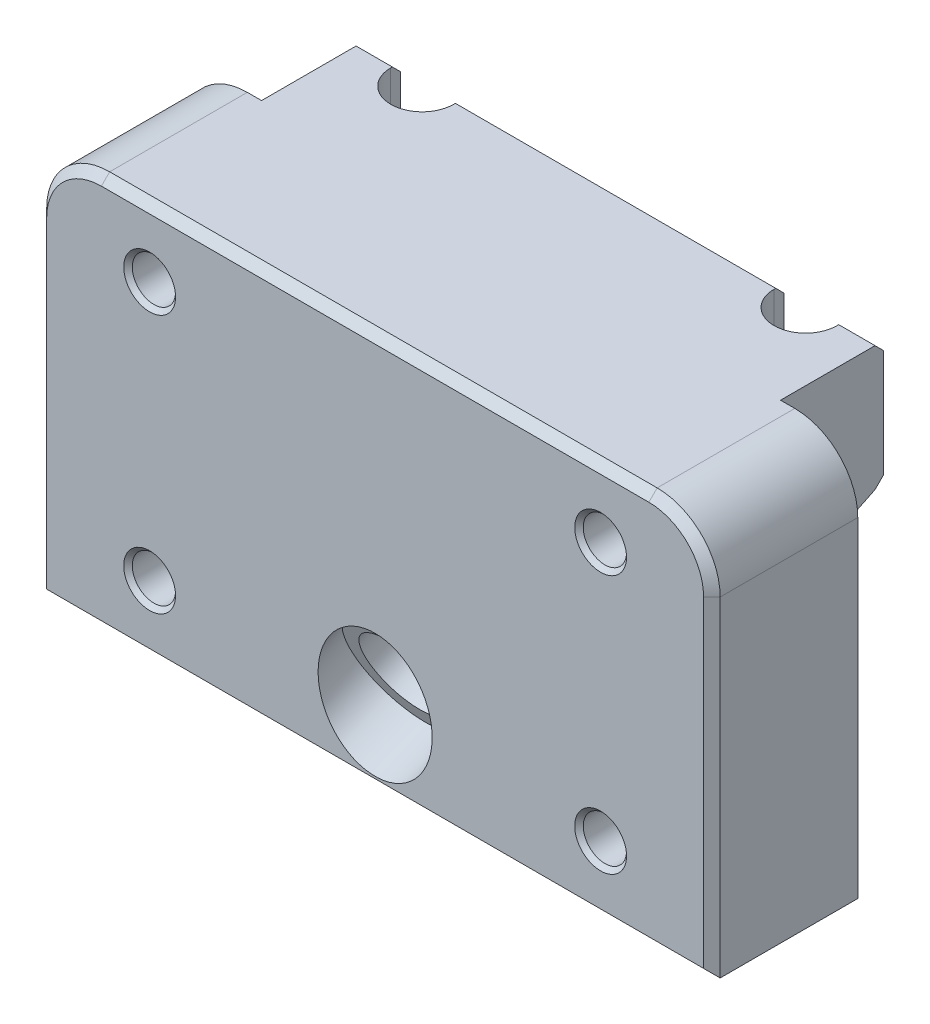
ISO-10303-21;
HEADER;
FILE_DESCRIPTION(('STEP AP214'),'2;1');
FILE_NAME('part.step','',(''),(''),'','','');
FILE_SCHEMA(('AUTOMOTIVE_DESIGN { 1 0 10303 214 1 1 1 1 }'));
ENDSEC;
DATA;
#1=APPLICATION_CONTEXT('core data for automotive mechanical design processes');
#2=APPLICATION_PROTOCOL_DEFINITION('international standard','automotive_design',2000,#1);
#3=PRODUCT_CONTEXT('',#1,'mechanical');
#4=PRODUCT('Part','Part','',(#3));
#5=PRODUCT_RELATED_PRODUCT_CATEGORY('part','',(#4));
#6=PRODUCT_DEFINITION_FORMATION('','',#4);
#7=PRODUCT_DEFINITION_CONTEXT('part definition',#1,'design');
#8=PRODUCT_DEFINITION('design','',#6,#7);
#9=PRODUCT_DEFINITION_SHAPE('','',#8);
#10=(LENGTH_UNIT() NAMED_UNIT(*) SI_UNIT(.MILLI.,.METRE.));
#11=(NAMED_UNIT(*) PLANE_ANGLE_UNIT() SI_UNIT($,.RADIAN.));
#12=(NAMED_UNIT(*) SI_UNIT($,.STERADIAN.) SOLID_ANGLE_UNIT());
#13=UNCERTAINTY_MEASURE_WITH_UNIT(LENGTH_MEASURE(1.E-05),#10,'distance_accuracy_value','');
#14=(GEOMETRIC_REPRESENTATION_CONTEXT(3) GLOBAL_UNCERTAINTY_ASSIGNED_CONTEXT((#13)) GLOBAL_UNIT_ASSIGNED_CONTEXT((#10,
#11,#12)) REPRESENTATION_CONTEXT('',''));
#15=CARTESIAN_POINT('',(0.,0.,0.));
#16=DIRECTION('',(0.,0.,1.));
#17=DIRECTION('',(1.,0.,0.));
#18=AXIS2_PLACEMENT_3D('',#15,#16,#17);
#19=CARTESIAN_POINT('',(39.751,60.198,-15.748));
#20=DIRECTION('',(0.,0.,1.));
#21=DIRECTION('',(1.,0.,0.));
#22=AXIS2_PLACEMENT_3D('',#19,#20,#21);
#23=PLANE('',#22);
#24=DIRECTION('',(0.,-1.,0.));
#25=VECTOR('',#24,1.);
#26=CARTESIAN_POINT('',(34.1884,60.198,-15.748));
#27=LINE('',#26,#25);
#28=CARTESIAN_POINT('',(34.1884,58.928,-15.748));
#29=VERTEX_POINT('',#28);
#30=CARTESIAN_POINT('',(34.1884,42.3654504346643,-15.748));
#31=VERTEX_POINT('',#30);
#32=EDGE_CURVE('E390',#29,#31,#27,.T.);
#33=ORIENTED_EDGE('',*,*,#32,.F.);
#34=DIRECTION('',(1.,0.,0.));
#35=VECTOR('',#34,1.);
#36=CARTESIAN_POINT('',(39.751,58.928,-15.748));
#37=LINE('',#36,#35);
#38=CARTESIAN_POINT('',(39.751,58.928,-15.748));
#39=VERTEX_POINT('',#38);
#40=EDGE_CURVE('E671',#29,#39,#37,.T.);
#41=ORIENTED_EDGE('',*,*,#40,.T.);
#42=DIRECTION('',(0.,-1.,0.));
#43=VECTOR('',#42,1.);
#44=CARTESIAN_POINT('',(39.751,60.198,-15.748));
#45=LINE('',#44,#43);
#46=CARTESIAN_POINT('',(39.751,42.3654504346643,-15.748));
#47=VERTEX_POINT('',#46);
#48=EDGE_CURVE('E626',#39,#47,#45,.T.);
#49=ORIENTED_EDGE('',*,*,#48,.T.);
#50=DIRECTION('',(-1.,0.,0.));
#51=VECTOR('',#50,1.);
#52=CARTESIAN_POINT('',(39.751,42.3654504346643,-15.748));
#53=LINE('',#52,#51);
#54=EDGE_CURVE('E702',#47,#31,#53,.T.);
#55=ORIENTED_EDGE('',*,*,#54,.T.);
#56=EDGE_LOOP('',(#33,#41,#49,#55));
#57=FACE_BOUND('',#56,.T.);
#58=ADVANCED_FACE('F17',(#57),#23,.F.);
#59=DIRECTION('',(0.,1.,0.));
#60=VECTOR('',#59,1.);
#61=CARTESIAN_POINT('',(24.5364,60.198,-15.748));
#62=LINE('',#61,#60);
#63=CARTESIAN_POINT('',(24.5364,42.3654504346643,-15.748));
#64=VERTEX_POINT('',#63);
#65=CARTESIAN_POINT('',(24.5364,58.928,-15.748));
#66=VERTEX_POINT('',#65);
#67=EDGE_CURVE('E384',#64,#66,#62,.T.);
#68=ORIENTED_EDGE('',*,*,#67,.F.);
#69=CARTESIAN_POINT('',(-24.5364,42.3654504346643,-15.748));
#70=VERTEX_POINT('',#69);
#71=EDGE_CURVE('E499',#64,#70,#53,.T.);
#72=ORIENTED_EDGE('',*,*,#71,.T.);
#73=DIRECTION('',(0.,1.,0.));
#74=VECTOR('',#73,1.);
#75=CARTESIAN_POINT('',(-24.5364,60.198,-15.748));
#76=LINE('',#75,#74);
#77=CARTESIAN_POINT('',(-24.5364,58.928,-15.748));
#78=VERTEX_POINT('',#77);
#79=EDGE_CURVE('E417',#70,#78,#76,.T.);
#80=ORIENTED_EDGE('',*,*,#79,.T.);
#81=EDGE_CURVE('E676',#78,#66,#37,.T.);
#82=ORIENTED_EDGE('',*,*,#81,.T.);
#83=EDGE_LOOP('',(#68,#72,#80,#82));
#84=FACE_BOUND('',#83,.T.);
#85=ADVANCED_FACE('F1004',(#84),#23,.F.);
#86=CARTESIAN_POINT('',(-51.5874,60.198,-14.478));
#87=DIRECTION('',(0.,-0.707106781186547,0.707106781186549));
#88=DIRECTION('',(0.,-0.707106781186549,-0.707106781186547));
#89=AXIS2_PLACEMENT_3D('',#86,#87,#88);
#90=PLANE('',#89);
#91=ORIENTED_EDGE('',*,*,#40,.F.);
#92=DIRECTION('',(0.,-0.707106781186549,-0.707106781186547));
#93=VECTOR('',#92,1.);
#94=CARTESIAN_POINT('',(34.1884,60.198,-14.478));
#95=LINE('',#94,#93);
#96=CARTESIAN_POINT('',(34.1884,60.198,-14.478));
#97=VERTEX_POINT('',#96);
#98=EDGE_CURVE('E392',#29,#97,#95,.F.);
#99=ORIENTED_EDGE('',*,*,#98,.T.);
#100=DIRECTION('',(-1.,0.,0.));
#101=VECTOR('',#100,1.);
#102=CARTESIAN_POINT('',(-51.5874,60.198,-14.478));
#103=LINE('',#102,#101);
#104=CARTESIAN_POINT('',(39.751,60.198,-14.478));
#105=VERTEX_POINT('',#104);
#106=EDGE_CURVE('E666',#105,#97,#103,.T.);
#107=ORIENTED_EDGE('',*,*,#106,.F.);
#108=DIRECTION('',(0.,-0.707106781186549,-0.707106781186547));
#109=VECTOR('',#108,1.);
#110=CARTESIAN_POINT('',(39.751,60.198,-14.478));
#111=LINE('',#110,#109);
#112=EDGE_CURVE('E675',#39,#105,#111,.F.);
#113=ORIENTED_EDGE('',*,*,#112,.F.);
#114=EDGE_LOOP('',(#91,#99,#107,#113));
#115=FACE_BOUND('',#114,.T.);
#116=ADVANCED_FACE('F1009',(#115),#90,.F.);
#117=CARTESIAN_POINT('',(24.5364,60.198,-14.478));
#118=VERTEX_POINT('',#117);
#119=CARTESIAN_POINT('',(-24.5364,60.198,-14.478));
#120=VERTEX_POINT('',#119);
#121=EDGE_CURVE('E669',#118,#120,#103,.T.);
#122=ORIENTED_EDGE('',*,*,#121,.F.);
#123=DIRECTION('',(0.,0.707106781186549,0.707106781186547));
#124=VECTOR('',#123,1.);
#125=CARTESIAN_POINT('',(24.5364,60.198,-14.478));
#126=LINE('',#125,#124);
#127=EDGE_CURVE('E371',#118,#66,#126,.F.);
#128=ORIENTED_EDGE('',*,*,#127,.T.);
#129=ORIENTED_EDGE('',*,*,#81,.F.);
#130=DIRECTION('',(0.,0.707106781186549,0.707106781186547));
#131=VECTOR('',#130,1.);
#132=CARTESIAN_POINT('',(-24.5364,60.198,-14.478));
#133=LINE('',#132,#131);
#134=EDGE_CURVE('E420',#120,#78,#133,.F.);
#135=ORIENTED_EDGE('',*,*,#134,.F.);
#136=EDGE_LOOP('',(#122,#128,#129,#135));
#137=FACE_BOUND('',#136,.T.);
#138=ADVANCED_FACE('F1064',(#137),#90,.F.);
#139=CARTESIAN_POINT('',(39.751,42.3654504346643,-15.748));
#140=DIRECTION('',(0.,0.707106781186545,0.70710678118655));
#141=DIRECTION('',(0.,-0.70710678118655,0.707106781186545));
#142=AXIS2_PLACEMENT_3D('',#139,#140,#141);
#143=PLANE('',#142);
#144=DIRECTION('',(1.,0.,0.));
#145=VECTOR('',#144,1.);
#146=CARTESIAN_POINT('',(233.71391617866,41.101071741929,-14.4836213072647));
#147=LINE('',#146,#145);
#148=CARTESIAN_POINT('',(34.1884,41.101071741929,-14.4836213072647));
#149=VERTEX_POINT('',#148);
#150=CARTESIAN_POINT('',(39.751,41.101071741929,-14.4836213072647));
#151=VERTEX_POINT('',#150);
#152=EDGE_CURVE('E503',#149,#151,#147,.T.);
#153=ORIENTED_EDGE('',*,*,#152,.F.);
#154=DIRECTION('',(0.,-0.70710678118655,0.707106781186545));
#155=VECTOR('',#154,1.);
#156=CARTESIAN_POINT('',(34.1884,42.3654504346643,-15.748));
#157=LINE('',#156,#155);
#158=EDGE_CURVE('E387',#149,#31,#157,.F.);
#159=ORIENTED_EDGE('',*,*,#158,.T.);
#160=ORIENTED_EDGE('',*,*,#54,.F.);
#161=DIRECTION('',(0.,-0.70710678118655,0.707106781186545));
#162=VECTOR('',#161,1.);
#163=CARTESIAN_POINT('',(39.751,42.3654504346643,-15.748));
#164=LINE('',#163,#162);
#165=EDGE_CURVE('E506',#151,#47,#164,.F.);
#166=ORIENTED_EDGE('',*,*,#165,.F.);
#167=EDGE_LOOP('',(#153,#159,#160,#166));
#168=FACE_BOUND('',#167,.T.);
#169=ADVANCED_FACE('F1079',(#168),#143,.F.);
#170=ORIENTED_EDGE('',*,*,#71,.F.);
#171=DIRECTION('',(0.,0.70710678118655,-0.707106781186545));
#172=VECTOR('',#171,1.);
#173=CARTESIAN_POINT('',(24.5364,42.3654504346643,-15.748));
#174=LINE('',#173,#172);
#175=CARTESIAN_POINT('',(24.5364,41.101071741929,-14.4836213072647));
#176=VERTEX_POINT('',#175);
#177=EDGE_CURVE('E380',#64,#176,#174,.F.);
#178=ORIENTED_EDGE('',*,*,#177,.T.);
#179=CARTESIAN_POINT('',(-24.5364,41.101071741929,-14.4836213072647));
#180=VERTEX_POINT('',#179);
#181=EDGE_CURVE('E498',#180,#176,#147,.T.);
#182=ORIENTED_EDGE('',*,*,#181,.F.);
#183=DIRECTION('',(0.,0.70710678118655,-0.707106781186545));
#184=VECTOR('',#183,1.);
#185=CARTESIAN_POINT('',(-24.5364,42.3654504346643,-15.748));
#186=LINE('',#185,#184);
#187=EDGE_CURVE('E483',#70,#180,#186,.F.);
#188=ORIENTED_EDGE('',*,*,#187,.F.);
#189=EDGE_LOOP('',(#170,#178,#182,#188));
#190=FACE_BOUND('',#189,.T.);
#191=ADVANCED_FACE('F496',(#190),#143,.F.);
#192=CARTESIAN_POINT('',(-51.5874,60.198,22.352));
#193=DIRECTION('',(0.,-1.,0.));
#194=DIRECTION('',(0.,0.,-1.));
#195=AXIS2_PLACEMENT_3D('',#192,#193,#194);
#196=PLANE('',#195);
#197=DIRECTION('',(0.,0.,1.));
#198=VECTOR('',#197,1.);
#199=CARTESIAN_POINT('',(34.1884,60.198,-21.6808175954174));
#200=LINE('',#199,#198);
#201=CARTESIAN_POINT('',(34.1884,60.198,-14.224));
#202=VERTEX_POINT('',#201);
#203=EDGE_CURVE('E365',#97,#202,#200,.T.);
#204=ORIENTED_EDGE('',*,*,#203,.T.);
#205=CARTESIAN_POINT('',(29.3624,60.198,-14.224));
#206=DIRECTION('',(0.,-1.,0.));
#207=DIRECTION('',(0.,0.,1.));
#208=AXIS2_PLACEMENT_3D('',#205,#206,#207);
#209=CIRCLE('',#208,4.826);
#210=CARTESIAN_POINT('',(24.5364,60.198,-14.224));
#211=VERTEX_POINT('',#210);
#212=EDGE_CURVE('E360',#202,#211,#209,.T.);
#213=ORIENTED_EDGE('',*,*,#212,.T.);
#214=DIRECTION('',(0.,0.,-1.));
#215=VECTOR('',#214,1.);
#216=CARTESIAN_POINT('',(24.5364,60.198,-14.224));
#217=LINE('',#216,#215);
#218=EDGE_CURVE('E368',#211,#118,#217,.T.);
#219=ORIENTED_EDGE('',*,*,#218,.T.);
#220=ORIENTED_EDGE('',*,*,#121,.T.);
#221=DIRECTION('',(0.,0.,-1.));
#222=VECTOR('',#221,1.);
#223=CARTESIAN_POINT('',(-24.5364,60.198,-14.224));
#224=LINE('',#223,#222);
#225=CARTESIAN_POINT('',(-24.5364,60.198,-14.224));
#226=VERTEX_POINT('',#225);
#227=EDGE_CURVE('E401',#226,#120,#224,.T.);
#228=ORIENTED_EDGE('',*,*,#227,.F.);
#229=CARTESIAN_POINT('',(-29.3624,60.198,-14.224));
#230=DIRECTION('',(0.,1.,0.));
#231=DIRECTION('',(0.,0.,1.));
#232=AXIS2_PLACEMENT_3D('',#229,#230,#231);
#233=CIRCLE('',#232,4.826);
#234=CARTESIAN_POINT('',(-34.1884,60.198,-14.224));
#235=VERTEX_POINT('',#234);
#236=EDGE_CURVE('E398',#235,#226,#233,.T.);
#237=ORIENTED_EDGE('',*,*,#236,.F.);
#238=DIRECTION('',(0.,0.,1.));
#239=VECTOR('',#238,1.);
#240=CARTESIAN_POINT('',(-34.1884,60.198,-21.6808175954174));
#241=LINE('',#240,#239);
#242=CARTESIAN_POINT('',(-34.1884,60.198,-14.478));
#243=VERTEX_POINT('',#242);
#244=EDGE_CURVE('E395',#243,#235,#241,.T.);
#245=ORIENTED_EDGE('',*,*,#244,.F.);
#246=CARTESIAN_POINT('',(-39.751,60.198,-14.478));
#247=VERTEX_POINT('',#246);
#248=EDGE_CURVE('E665',#243,#247,#103,.T.);
#249=ORIENTED_EDGE('',*,*,#248,.T.);
#250=DIRECTION('',(0.,0.,1.));
#251=VECTOR('',#250,1.);
#252=CARTESIAN_POINT('',(-39.751,60.198,0.));
#253=LINE('',#252,#251);
#254=CARTESIAN_POINT('',(-39.751,60.198,0.));
#255=VERTEX_POINT('',#254);
#256=EDGE_CURVE('E643',#247,#255,#253,.T.);
#257=ORIENTED_EDGE('',*,*,#256,.T.);
#258=DIRECTION('',(-1.,0.,0.));
#259=VECTOR('',#258,1.);
#260=CARTESIAN_POINT('',(51.5874,60.198,0.));
#261=LINE('',#260,#259);
#262=CARTESIAN_POINT('',(-41.9354,60.198,0.));
#263=VERTEX_POINT('',#262);
#264=EDGE_CURVE('E613',#255,#263,#261,.T.);
#265=ORIENTED_EDGE('',*,*,#264,.T.);
#266=DIRECTION('',(0.,0.,-1.));
#267=VECTOR('',#266,1.);
#268=CARTESIAN_POINT('',(-41.9354,60.198,22.352));
#269=LINE('',#268,#267);
#270=CARTESIAN_POINT('',(-41.9354,60.198,21.082));
#271=VERTEX_POINT('',#270);
#272=EDGE_CURVE('E620',#263,#271,#269,.F.);
#273=ORIENTED_EDGE('',*,*,#272,.T.);
#274=DIRECTION('',(1.,0.,0.));
#275=VECTOR('',#274,1.);
#276=CARTESIAN_POINT('',(-51.5874,60.198,21.082));
#277=LINE('',#276,#275);
#278=CARTESIAN_POINT('',(41.9354,60.198,21.082));
#279=VERTEX_POINT('',#278);
#280=EDGE_CURVE('E660',#271,#279,#277,.T.);
#281=ORIENTED_EDGE('',*,*,#280,.T.);
#282=DIRECTION('',(0.,0.,-1.));
#283=VECTOR('',#282,1.);
#284=CARTESIAN_POINT('',(41.9354,60.198,22.352));
#285=LINE('',#284,#283);
#286=CARTESIAN_POINT('',(41.9354,60.198,0.));
#287=VERTEX_POINT('',#286);
#288=EDGE_CURVE('E640',#279,#287,#285,.T.);
#289=ORIENTED_EDGE('',*,*,#288,.T.);
#290=CARTESIAN_POINT('',(39.751,60.198,0.));
#291=VERTEX_POINT('',#290);
#292=EDGE_CURVE('E616',#287,#291,#261,.T.);
#293=ORIENTED_EDGE('',*,*,#292,.T.);
#294=DIRECTION('',(0.,0.,1.));
#295=VECTOR('',#294,1.);
#296=CARTESIAN_POINT('',(39.751,60.198,0.));
#297=LINE('',#296,#295);
#298=EDGE_CURVE('E601',#105,#291,#297,.T.);
#299=ORIENTED_EDGE('',*,*,#298,.F.);
#300=ORIENTED_EDGE('',*,*,#106,.T.);
#301=EDGE_LOOP('',(#204,#213,#219,#220,#228,#237,#245,#249,#257,#265,#273,#281,#289,#293,#299,#300));
#302=FACE_BOUND('',#301,.T.);
#303=ADVANCED_FACE('F375',(#302),#196,.F.);
#304=CARTESIAN_POINT('',(233.71391617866,34.0369376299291,0.));
#305=DIRECTION('',(0.,0.898794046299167,0.438371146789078));
#306=DIRECTION('',(0.,-0.438371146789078,0.898794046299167));
#307=AXIS2_PLACEMENT_3D('',#304,#305,#306);
#308=PLANE('',#307);
#309=DIRECTION('',(0.,-0.438371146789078,0.898794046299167));
#310=VECTOR('',#309,1.);
#311=CARTESIAN_POINT('',(34.1884,34.0369376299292,-1.49595827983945E-13));
#312=LINE('',#311,#310);
#313=CARTESIAN_POINT('',(34.1884,40.9744459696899,-14.224));
#314=VERTEX_POINT('',#313);
#315=EDGE_CURVE('E10',#149,#314,#312,.T.);
#316=ORIENTED_EDGE('',*,*,#315,.F.);
#317=ORIENTED_EDGE('',*,*,#152,.T.);
#318=DIRECTION('',(0.,0.438371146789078,-0.898794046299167));
#319=VECTOR('',#318,1.);
#320=CARTESIAN_POINT('',(39.751,39.0642896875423,-10.307599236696));
#321=LINE('',#320,#319);
#322=CARTESIAN_POINT('',(39.751,34.7327063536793,-1.42653728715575));
#323=VERTEX_POINT('',#322);
#324=EDGE_CURVE('E602',#323,#151,#321,.T.);
#325=ORIENTED_EDGE('',*,*,#324,.F.);
#326=DIRECTION('',(-1.,0.,0.));
#327=VECTOR('',#326,1.);
#328=CARTESIAN_POINT('',(-39.751,34.7327063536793,-1.42653728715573));
#329=LINE('',#328,#327);
#330=CARTESIAN_POINT('',(-39.751,34.7327063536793,-1.42653728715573));
#331=VERTEX_POINT('',#330);
#332=EDGE_CURVE('E512',#323,#331,#329,.T.);
#333=ORIENTED_EDGE('',*,*,#332,.T.);
#334=DIRECTION('',(0.,0.438371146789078,-0.898794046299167));
#335=VECTOR('',#334,1.);
#336=CARTESIAN_POINT('',(-39.751,39.0642896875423,-10.307599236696));
#337=LINE('',#336,#335);
#338=CARTESIAN_POINT('',(-39.751,41.101071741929,-14.4836213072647));
#339=VERTEX_POINT('',#338);
#340=EDGE_CURVE('E605',#331,#339,#337,.T.);
#341=ORIENTED_EDGE('',*,*,#340,.T.);
#342=CARTESIAN_POINT('',(-34.1884,41.101071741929,-14.4836213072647));
#343=VERTEX_POINT('',#342);
#344=EDGE_CURVE('E502',#339,#343,#147,.T.);
#345=ORIENTED_EDGE('',*,*,#344,.T.);
#346=DIRECTION('',(0.,-0.438371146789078,0.898794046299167));
#347=VECTOR('',#346,1.);
#348=CARTESIAN_POINT('',(-34.1884,34.036937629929,2.01779828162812E-13));
#349=LINE('',#348,#347);
#350=CARTESIAN_POINT('',(-34.1884,40.9744459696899,-14.224));
#351=VERTEX_POINT('',#350);
#352=EDGE_CURVE('E40',#343,#351,#349,.T.);
#353=ORIENTED_EDGE('',*,*,#352,.T.);
#354=CARTESIAN_POINT('',(-29.3624,40.9744459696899,-14.224));
#355=DIRECTION('',(0.,0.898794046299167,0.438371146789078));
#356=DIRECTION('',(0.,0.438371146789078,-0.898794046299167));
#357=AXIS2_PLACEMENT_3D('',#354,#355,#356);
#358=ELLIPSE('',#357,5.36941696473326,4.826);
#359=CARTESIAN_POINT('',(-24.5364,40.9744459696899,-14.224));
#360=VERTEX_POINT('',#359);
#361=EDGE_CURVE('E486',#351,#360,#358,.T.);
#362=ORIENTED_EDGE('',*,*,#361,.T.);
#363=DIRECTION('',(0.,0.438371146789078,-0.898794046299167));
#364=VECTOR('',#363,1.);
#365=CARTESIAN_POINT('',(-24.5364,34.0369376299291,0.));
#366=LINE('',#365,#364);
#367=EDGE_CURVE('E414',#360,#180,#366,.T.);
#368=ORIENTED_EDGE('',*,*,#367,.T.);
#369=ORIENTED_EDGE('',*,*,#181,.T.);
#370=DIRECTION('',(0.,0.438371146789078,-0.898794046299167));
#371=VECTOR('',#370,1.);
#372=CARTESIAN_POINT('',(24.5364,34.0369376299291,0.));
#373=LINE('',#372,#371);
#374=CARTESIAN_POINT('',(24.5364,40.9744459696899,-14.224));
#375=VERTEX_POINT('',#374);
#376=EDGE_CURVE('E489',#375,#176,#373,.T.);
#377=ORIENTED_EDGE('',*,*,#376,.F.);
#378=CARTESIAN_POINT('',(29.3624,40.9744459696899,-14.224));
#379=DIRECTION('',(0.,0.898794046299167,0.438371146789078));
#380=DIRECTION('',(0.,0.438371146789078,-0.898794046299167));
#381=AXIS2_PLACEMENT_3D('',#378,#379,#380);
#382=ELLIPSE('',#381,5.36941696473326,4.826);
#383=EDGE_CURVE('E25',#314,#375,#382,.F.);
#384=ORIENTED_EDGE('',*,*,#383,.F.);
#385=EDGE_LOOP('',(#316,#317,#325,#333,#341,#345,#353,#362,#368,#369,#377,#384));
#386=FACE_BOUND('',#385,.T.);
#387=ADVANCED_FACE('F501',(#386),#308,.F.);
#388=CARTESIAN_POINT('',(0.,60.198,22.352));
#389=DIRECTION('',(0.,0.,-1.));
#390=DIRECTION('',(-1.,0.,0.));
#391=AXIS2_PLACEMENT_3D('',#388,#389,#390);
#392=PLANE('',#391);
#393=DIRECTION('',(0.999999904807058,-0.00043633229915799,0.));
#394=VECTOR('',#393,1.);
#395=CARTESIAN_POINT('',(-30.575250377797,10.2852683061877,22.352));
#396=LINE('',#395,#394);
#397=CARTESIAN_POINT('',(-30.5749963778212,10.2852681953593,22.352));
#398=VERTEX_POINT('',#397);
#399=CARTESIAN_POINT('',(-30.575250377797,10.2852683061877,22.352));
#400=VERTEX_POINT('',#399);
#401=EDGE_CURVE('E845',#398,#400,#396,.F.);
#402=ORIENTED_EDGE('',*,*,#401,.F.);
#403=CARTESIAN_POINT('',(-34.544,10.287,22.352));
#404=DIRECTION('',(0.,0.,1.));
#405=DIRECTION('',(1.,0.,0.));
#406=AXIS2_PLACEMENT_3D('',#403,#404,#405);
#407=CIRCLE('',#406,3.969004);
#408=CARTESIAN_POINT('',(-30.574996,10.287,22.352));
#409=VERTEX_POINT('',#408);
#410=EDGE_CURVE('E822',#409,#398,#407,.T.);
#411=ORIENTED_EDGE('',*,*,#410,.F.);
#412=DIRECTION('',(1.,0.,0.));
#413=VECTOR('',#412,1.);
#414=CARTESIAN_POINT('',(-30.57525,10.287,22.352));
#415=LINE('',#414,#413);
#416=CARTESIAN_POINT('',(-30.57525,10.287,22.352));
#417=VERTEX_POINT('',#416);
#418=EDGE_CURVE('E841',#409,#417,#415,.F.);
#419=ORIENTED_EDGE('',*,*,#418,.T.);
#420=CARTESIAN_POINT('',(-34.544,10.287,22.352));
#421=DIRECTION('',(0.,0.,-1.));
#422=DIRECTION('',(-1.,0.,0.));
#423=AXIS2_PLACEMENT_3D('',#420,#421,#422);
#424=CIRCLE('',#423,3.96875);
#425=EDGE_CURVE('E538',#417,#400,#424,.T.);
#426=ORIENTED_EDGE('',*,*,#425,.T.);
#427=EDGE_LOOP('',(#402,#411,#419,#426));
#428=FACE_BOUND('',#427,.T.);
#429=DIRECTION('',(0.999999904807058,-0.00043633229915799,0.));
#430=VECTOR('',#429,1.);
#431=CARTESIAN_POINT('',(-30.575250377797,49.9092683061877,22.352));
#432=LINE('',#431,#430);
#433=CARTESIAN_POINT('',(-30.5749963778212,49.9092681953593,22.352));
#434=VERTEX_POINT('',#433);
#435=CARTESIAN_POINT('',(-30.575250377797,49.9092683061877,22.352));
#436=VERTEX_POINT('',#435);
#437=EDGE_CURVE('E553',#434,#436,#432,.F.);
#438=ORIENTED_EDGE('',*,*,#437,.F.);
#439=CARTESIAN_POINT('',(-34.544,49.911,22.352));
#440=DIRECTION('',(0.,0.,1.));
#441=DIRECTION('',(1.,0.,0.));
#442=AXIS2_PLACEMENT_3D('',#439,#440,#441);
#443=CIRCLE('',#442,3.969004);
#444=CARTESIAN_POINT('',(-30.574996,49.911,22.352));
#445=VERTEX_POINT('',#444);
#446=EDGE_CURVE('E1891',#445,#434,#443,.T.);
#447=ORIENTED_EDGE('',*,*,#446,.F.);
#448=DIRECTION('',(1.,0.,0.));
#449=VECTOR('',#448,1.);
#450=CARTESIAN_POINT('',(-30.57525,49.911,22.352));
#451=LINE('',#450,#449);
#452=CARTESIAN_POINT('',(-30.57525,49.911,22.352));
#453=VERTEX_POINT('',#452);
#454=EDGE_CURVE('E557',#445,#453,#451,.F.);
#455=ORIENTED_EDGE('',*,*,#454,.T.);
#456=CARTESIAN_POINT('',(-34.544,49.911,22.352));
#457=DIRECTION('',(0.,0.,-1.));
#458=DIRECTION('',(-1.,0.,0.));
#459=AXIS2_PLACEMENT_3D('',#456,#457,#458);
#460=CIRCLE('',#459,3.96875);
#461=EDGE_CURVE('E526',#453,#436,#460,.T.);
#462=ORIENTED_EDGE('',*,*,#461,.T.);
#463=EDGE_LOOP('',(#438,#447,#455,#462));
#464=FACE_BOUND('',#463,.T.);
#465=DIRECTION('',(1.,0.,0.));
#466=VECTOR('',#465,1.);
#467=CARTESIAN_POINT('',(51.5874,1.27,22.352));
#468=LINE('',#467,#466);
#469=CARTESIAN_POINT('',(-50.3174,1.27,22.352));
#470=VERTEX_POINT('',#469);
#471=CARTESIAN_POINT('',(50.3174,1.27,22.352));
#472=VERTEX_POINT('',#471);
#473=EDGE_CURVE('E680',#470,#472,#468,.T.);
#474=ORIENTED_EDGE('',*,*,#473,.T.);
#475=DIRECTION('',(0.,1.,0.));
#476=VECTOR('',#475,1.);
#477=CARTESIAN_POINT('',(50.3174,60.198,22.352));
#478=LINE('',#477,#476);
#479=CARTESIAN_POINT('',(50.3174,50.546,22.352));
#480=VERTEX_POINT('',#479);
#481=EDGE_CURVE('E688',#472,#480,#478,.T.);
#482=ORIENTED_EDGE('',*,*,#481,.T.);
#483=CARTESIAN_POINT('',(41.9354,50.546,22.352));
#484=DIRECTION('',(0.,0.,-1.));
#485=DIRECTION('',(-1.,0.,0.));
#486=AXIS2_PLACEMENT_3D('',#483,#484,#485);
#487=CIRCLE('',#486,8.382);
#488=CARTESIAN_POINT('',(41.9354,58.928,22.352));
#489=VERTEX_POINT('',#488);
#490=EDGE_CURVE('E686',#480,#489,#487,.F.);
#491=ORIENTED_EDGE('',*,*,#490,.T.);
#492=DIRECTION('',(-1.,0.,0.));
#493=VECTOR('',#492,1.);
#494=CARTESIAN_POINT('',(0.,58.928,22.352));
#495=LINE('',#494,#493);
#496=CARTESIAN_POINT('',(-41.9354,58.928,22.352));
#497=VERTEX_POINT('',#496);
#498=EDGE_CURVE('E684',#489,#497,#495,.T.);
#499=ORIENTED_EDGE('',*,*,#498,.T.);
#500=CARTESIAN_POINT('',(-41.9354,50.546,22.352));
#501=DIRECTION('',(0.,0.,-1.));
#502=DIRECTION('',(-1.,0.,0.));
#503=AXIS2_PLACEMENT_3D('',#500,#501,#502);
#504=CIRCLE('',#503,8.382);
#505=CARTESIAN_POINT('',(-50.3174,50.546,22.352));
#506=VERTEX_POINT('',#505);
#507=EDGE_CURVE('E682',#497,#506,#504,.F.);
#508=ORIENTED_EDGE('',*,*,#507,.T.);
#509=DIRECTION('',(0.,-1.,0.));
#510=VECTOR('',#509,1.);
#511=CARTESIAN_POINT('',(-50.3174,0.,22.352));
#512=LINE('',#511,#510);
#513=EDGE_CURVE('E678',#506,#470,#512,.T.);
#514=ORIENTED_EDGE('',*,*,#513,.T.);
#515=EDGE_LOOP('',(#474,#482,#491,#499,#508,#514));
#516=FACE_BOUND('',#515,.T.);
#517=CARTESIAN_POINT('',(0.,11.0867451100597,22.352));
#518=DIRECTION('',(0.,0.,-1.));
#519=DIRECTION('',(0.,1.,0.));
#520=AXIS2_PLACEMENT_3D('',#517,#518,#519);
#521=ELLIPSE('',#520,9.49218243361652,8.7376);
#522=CARTESIAN_POINT('',(0.,20.5789275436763,22.352));
#523=VERTEX_POINT('',#522);
#524=EDGE_CURVE('E606',#523,#523,#521,.F.);
#525=ORIENTED_EDGE('',*,*,#524,.F.);
#526=EDGE_LOOP('',(#525));
#527=FACE_BOUND('',#526,.T.);
#528=DIRECTION('',(0.999999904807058,-0.00043633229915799,0.));
#529=VECTOR('',#528,1.);
#530=CARTESIAN_POINT('',(38.512749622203,49.9092683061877,22.352));
#531=LINE('',#530,#529);
#532=CARTESIAN_POINT('',(38.5130036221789,49.9092681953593,22.352));
#533=VERTEX_POINT('',#532);
#534=CARTESIAN_POINT('',(38.512749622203,49.9092683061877,22.352));
#535=VERTEX_POINT('',#534);
#536=EDGE_CURVE('E809',#533,#535,#531,.F.);
#537=ORIENTED_EDGE('',*,*,#536,.F.);
#538=CARTESIAN_POINT('',(34.544,49.911,22.352));
#539=DIRECTION('',(0.,0.,1.));
#540=DIRECTION('',(1.,0.,0.));
#541=AXIS2_PLACEMENT_3D('',#538,#539,#540);
#542=CIRCLE('',#541,3.969004);
#543=CARTESIAN_POINT('',(38.513004,49.911,22.352));
#544=VERTEX_POINT('',#543);
#545=EDGE_CURVE('E858',#544,#533,#542,.T.);
#546=ORIENTED_EDGE('',*,*,#545,.F.);
#547=DIRECTION('',(1.,0.,0.));
#548=VECTOR('',#547,1.);
#549=CARTESIAN_POINT('',(38.51275,49.911,22.352));
#550=LINE('',#549,#548);
#551=CARTESIAN_POINT('',(38.51275,49.911,22.352));
#552=VERTEX_POINT('',#551);
#553=EDGE_CURVE('E900',#544,#552,#550,.F.);
#554=ORIENTED_EDGE('',*,*,#553,.T.);
#555=CARTESIAN_POINT('',(34.544,49.911,22.352));
#556=DIRECTION('',(0.,0.,-1.));
#557=DIRECTION('',(-1.,0.,0.));
#558=AXIS2_PLACEMENT_3D('',#555,#556,#557);
#559=CIRCLE('',#558,3.96875);
#560=EDGE_CURVE('E531',#552,#535,#559,.T.);
#561=ORIENTED_EDGE('',*,*,#560,.T.);
#562=EDGE_LOOP('',(#537,#546,#554,#561));
#563=FACE_BOUND('',#562,.T.);
#564=DIRECTION('',(0.999999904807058,-0.000436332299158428,0.));
#565=VECTOR('',#564,1.);
#566=CARTESIAN_POINT('',(38.512749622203,10.2852683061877,22.352));
#567=LINE('',#566,#565);
#568=CARTESIAN_POINT('',(38.5130036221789,10.2852681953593,22.352));
#569=VERTEX_POINT('',#568);
#570=CARTESIAN_POINT('',(38.512749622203,10.2852683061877,22.352));
#571=VERTEX_POINT('',#570);
#572=EDGE_CURVE('E478',#569,#571,#567,.F.);
#573=ORIENTED_EDGE('',*,*,#572,.F.);
#574=CARTESIAN_POINT('',(34.544,10.287,22.352));
#575=DIRECTION('',(0.,0.,1.));
#576=DIRECTION('',(1.,0.,0.));
#577=AXIS2_PLACEMENT_3D('',#574,#575,#576);
#578=CIRCLE('',#577,3.969004);
#579=CARTESIAN_POINT('',(38.513004,10.287,22.352));
#580=VERTEX_POINT('',#579);
#581=EDGE_CURVE('E428',#580,#569,#578,.T.);
#582=ORIENTED_EDGE('',*,*,#581,.F.);
#583=DIRECTION('',(1.,0.,0.));
#584=VECTOR('',#583,1.);
#585=CARTESIAN_POINT('',(38.51275,10.287,22.352));
#586=LINE('',#585,#584);
#587=CARTESIAN_POINT('',(38.51275,10.287,22.352));
#588=VERTEX_POINT('',#587);
#589=EDGE_CURVE('E469',#580,#588,#586,.F.);
#590=ORIENTED_EDGE('',*,*,#589,.T.);
#591=CARTESIAN_POINT('',(34.544,10.287,22.352));
#592=DIRECTION('',(0.,0.,-1.));
#593=DIRECTION('',(-1.,0.,0.));
#594=AXIS2_PLACEMENT_3D('',#591,#592,#593);
#595=CIRCLE('',#594,3.96875);
#596=EDGE_CURVE('E815',#588,#571,#595,.T.);
#597=ORIENTED_EDGE('',*,*,#596,.T.);
#598=EDGE_LOOP('',(#573,#582,#590,#597));
#599=FACE_BOUND('',#598,.T.);
#600=ADVANCED_FACE('F797',(#428,#464,#516,#527,#563,#599),#392,.F.);
#601=CARTESIAN_POINT('',(-39.751,60.198,0.));
#602=DIRECTION('',(-1.,0.,0.));
#603=DIRECTION('',(0.,0.,1.));
#604=AXIS2_PLACEMENT_3D('',#601,#602,#603);
#605=PLANE('',#604);
#606=DIRECTION('',(0.,-1.,0.));
#607=VECTOR('',#606,1.);
#608=CARTESIAN_POINT('',(-39.751,60.198,-15.748));
#609=LINE('',#608,#607);
#610=CARTESIAN_POINT('',(-39.751,58.928,-15.748));
#611=VERTEX_POINT('',#610);
#612=CARTESIAN_POINT('',(-39.751,42.3654504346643,-15.748));
#613=VERTEX_POINT('',#612);
#614=EDGE_CURVE('E623',#611,#613,#609,.T.);
#615=ORIENTED_EDGE('',*,*,#614,.T.);
#616=DIRECTION('',(0.,0.70710678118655,-0.707106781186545));
#617=VECTOR('',#616,1.);
#618=CARTESIAN_POINT('',(-39.751,43.4077252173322,-16.7902747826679));
#619=LINE('',#618,#617);
#620=EDGE_CURVE('E507',#613,#339,#619,.F.);
#621=ORIENTED_EDGE('',*,*,#620,.T.);
#622=ORIENTED_EDGE('',*,*,#340,.F.);
#623=CARTESIAN_POINT('',(-39.751,32.4497694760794,-2.54));
#624=DIRECTION('',(-1.,0.,0.));
#625=DIRECTION('',(0.,0.,1.));
#626=AXIS2_PLACEMENT_3D('',#623,#624,#625);
#627=CIRCLE('',#626,2.54);
#628=CARTESIAN_POINT('',(-39.751,32.4497694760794,0.));
#629=VERTEX_POINT('',#628);
#630=EDGE_CURVE('E518',#331,#629,#627,.F.);
#631=ORIENTED_EDGE('',*,*,#630,.T.);
#632=DIRECTION('',(0.,-1.,0.));
#633=VECTOR('',#632,1.);
#634=CARTESIAN_POINT('',(-39.751,60.198,0.));
#635=LINE('',#634,#633);
#636=EDGE_CURVE('E621',#255,#629,#635,.T.);
#637=ORIENTED_EDGE('',*,*,#636,.F.);
#638=ORIENTED_EDGE('',*,*,#256,.F.);
#639=DIRECTION('',(0.,0.707106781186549,0.707106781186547));
#640=VECTOR('',#639,1.);
#641=CARTESIAN_POINT('',(-39.751,67.437,-7.239));
#642=LINE('',#641,#640);
#643=EDGE_CURVE('E668',#247,#611,#642,.F.);
#644=ORIENTED_EDGE('',*,*,#643,.T.);
#645=EDGE_LOOP('',(#615,#621,#622,#631,#637,#638,#644));
#646=FACE_BOUND('',#645,.T.);
#647=ADVANCED_FACE('F719',(#646),#605,.T.);
#648=CARTESIAN_POINT('',(39.751,60.198,0.));
#649=DIRECTION('',(-1.,0.,0.));
#650=DIRECTION('',(0.,0.,1.));
#651=AXIS2_PLACEMENT_3D('',#648,#649,#650);
#652=PLANE('',#651);
#653=DIRECTION('',(0.,-1.,0.));
#654=VECTOR('',#653,1.);
#655=CARTESIAN_POINT('',(39.751,60.198,0.));
#656=LINE('',#655,#654);
#657=CARTESIAN_POINT('',(39.751,32.4497694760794,0.));
#658=VERTEX_POINT('',#657);
#659=EDGE_CURVE('E629',#291,#658,#656,.T.);
#660=ORIENTED_EDGE('',*,*,#659,.T.);
#661=CARTESIAN_POINT('',(39.751,32.4497694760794,-2.54));
#662=DIRECTION('',(-1.,0.,0.));
#663=DIRECTION('',(0.,0.,1.));
#664=AXIS2_PLACEMENT_3D('',#661,#662,#663);
#665=CIRCLE('',#664,2.54);
#666=EDGE_CURVE('E521',#658,#323,#665,.T.);
#667=ORIENTED_EDGE('',*,*,#666,.T.);
#668=ORIENTED_EDGE('',*,*,#324,.T.);
#669=ORIENTED_EDGE('',*,*,#165,.T.);
#670=ORIENTED_EDGE('',*,*,#48,.F.);
#671=ORIENTED_EDGE('',*,*,#112,.T.);
#672=ORIENTED_EDGE('',*,*,#298,.T.);
#673=EDGE_LOOP('',(#660,#667,#668,#669,#670,#671,#672));
#674=FACE_BOUND('',#673,.T.);
#675=ADVANCED_FACE('F1014',(#674),#652,.F.);
#676=CARTESIAN_POINT('',(-34.1884,58.928,-15.748));
#677=VERTEX_POINT('',#676);
#678=EDGE_CURVE('E672',#611,#677,#37,.T.);
#679=ORIENTED_EDGE('',*,*,#678,.T.);
#680=DIRECTION('',(0.,-1.,0.));
#681=VECTOR('',#680,1.);
#682=CARTESIAN_POINT('',(-34.1884,60.198,-15.748));
#683=LINE('',#682,#681);
#684=CARTESIAN_POINT('',(-34.1884,42.3654504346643,-15.748));
#685=VERTEX_POINT('',#684);
#686=EDGE_CURVE('E409',#677,#685,#683,.T.);
#687=ORIENTED_EDGE('',*,*,#686,.T.);
#688=EDGE_CURVE('E701',#685,#613,#53,.T.);
#689=ORIENTED_EDGE('',*,*,#688,.T.);
#690=ORIENTED_EDGE('',*,*,#614,.F.);
#691=EDGE_LOOP('',(#679,#687,#689,#690));
#692=FACE_BOUND('',#691,.T.);
#693=ADVANCED_FACE('F712',(#692),#23,.F.);
#694=CARTESIAN_POINT('',(-51.5874,0.,22.352));
#695=DIRECTION('',(0.,-1.,0.));
#696=DIRECTION('',(0.,0.,-1.));
#697=AXIS2_PLACEMENT_3D('',#694,#695,#696);
#698=PLANE('',#697);
#699=DIRECTION('',(0.,0.,-1.));
#700=VECTOR('',#699,1.);
#701=CARTESIAN_POINT('',(51.5874,0.,22.352));
#702=LINE('',#701,#700);
#703=CARTESIAN_POINT('',(51.5874,0.,21.082));
#704=VERTEX_POINT('',#703);
#705=CARTESIAN_POINT('',(51.5874,0.,0.));
#706=VERTEX_POINT('',#705);
#707=EDGE_CURVE('E612',#704,#706,#702,.T.);
#708=ORIENTED_EDGE('',*,*,#707,.F.);
#709=DIRECTION('',(-1.,0.,0.));
#710=VECTOR('',#709,1.);
#711=CARTESIAN_POINT('',(-51.5874,0.,21.082));
#712=LINE('',#711,#710);
#713=CARTESIAN_POINT('',(-51.5874,0.,21.082));
#714=VERTEX_POINT('',#713);
#715=EDGE_CURVE('E698',#704,#714,#712,.T.);
#716=ORIENTED_EDGE('',*,*,#715,.T.);
#717=DIRECTION('',(0.,0.,-1.));
#718=VECTOR('',#717,1.);
#719=CARTESIAN_POINT('',(-51.5874,0.,22.352));
#720=LINE('',#719,#718);
#721=CARTESIAN_POINT('',(-51.5874,0.,0.));
#722=VERTEX_POINT('',#721);
#723=EDGE_CURVE('E608',#714,#722,#720,.T.);
#724=ORIENTED_EDGE('',*,*,#723,.T.);
#725=DIRECTION('',(-1.,0.,0.));
#726=VECTOR('',#725,1.);
#727=CARTESIAN_POINT('',(51.5874,0.,0.));
#728=LINE('',#727,#726);
#729=EDGE_CURVE('E609',#706,#722,#728,.T.);
#730=ORIENTED_EDGE('',*,*,#729,.F.);
#731=EDGE_LOOP('',(#708,#716,#724,#730));
#732=FACE_BOUND('',#731,.T.);
#733=ADVANCED_FACE('F787',(#732),#698,.T.);
#734=CARTESIAN_POINT('',(-51.5874,60.198,22.352));
#735=DIRECTION('',(-1.,0.,0.));
#736=DIRECTION('',(0.,0.,1.));
#737=AXIS2_PLACEMENT_3D('',#734,#735,#736);
#738=PLANE('',#737);
#739=ORIENTED_EDGE('',*,*,#723,.F.);
#740=DIRECTION('',(0.,1.,0.));
#741=VECTOR('',#740,1.);
#742=CARTESIAN_POINT('',(-51.5874,50.546,21.082));
#743=LINE('',#742,#741);
#744=CARTESIAN_POINT('',(-51.5874,50.546,21.082));
#745=VERTEX_POINT('',#744);
#746=EDGE_CURVE('E700',#714,#745,#743,.T.);
#747=ORIENTED_EDGE('',*,*,#746,.T.);
#748=DIRECTION('',(0.,0.,-1.));
#749=VECTOR('',#748,1.);
#750=CARTESIAN_POINT('',(-51.5874,50.546,0.));
#751=LINE('',#750,#749);
#752=CARTESIAN_POINT('',(-51.5874,50.546,0.));
#753=VERTEX_POINT('',#752);
#754=EDGE_CURVE('E656',#745,#753,#751,.T.);
#755=ORIENTED_EDGE('',*,*,#754,.T.);
#756=DIRECTION('',(0.,-1.,0.));
#757=VECTOR('',#756,1.);
#758=CARTESIAN_POINT('',(-51.5874,60.198,0.));
#759=LINE('',#758,#757);
#760=EDGE_CURVE('E617',#753,#722,#759,.T.);
#761=ORIENTED_EDGE('',*,*,#760,.T.);
#762=EDGE_LOOP('',(#739,#747,#755,#761));
#763=FACE_BOUND('',#762,.T.);
#764=ADVANCED_FACE('F791',(#763),#738,.T.);
#765=CARTESIAN_POINT('',(51.5874,60.198,0.));
#766=DIRECTION('',(0.,0.,1.));
#767=DIRECTION('',(1.,0.,0.));
#768=AXIS2_PLACEMENT_3D('',#765,#766,#767);
#769=PLANE('',#768);
#770=ORIENTED_EDGE('',*,*,#636,.T.);
#771=DIRECTION('',(-1.,0.,0.));
#772=VECTOR('',#771,1.);
#773=CARTESIAN_POINT('',(39.751,32.4497694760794,0.));
#774=LINE('',#773,#772);
#775=EDGE_CURVE('E515',#629,#658,#774,.F.);
#776=ORIENTED_EDGE('',*,*,#775,.T.);
#777=ORIENTED_EDGE('',*,*,#659,.F.);
#778=ORIENTED_EDGE('',*,*,#292,.F.);
#779=CARTESIAN_POINT('',(41.9354,50.546,0.));
#780=DIRECTION('',(0.,0.,1.));
#781=DIRECTION('',(1.,0.,0.));
#782=AXIS2_PLACEMENT_3D('',#779,#780,#781);
#783=CIRCLE('',#782,9.652);
#784=CARTESIAN_POINT('',(51.5874,50.546,0.));
#785=VERTEX_POINT('',#784);
#786=EDGE_CURVE('E639',#287,#785,#783,.F.);
#787=ORIENTED_EDGE('',*,*,#786,.T.);
#788=DIRECTION('',(0.,-1.,0.));
#789=VECTOR('',#788,1.);
#790=CARTESIAN_POINT('',(51.5874,60.198,0.));
#791=LINE('',#790,#789);
#792=EDGE_CURVE('E615',#785,#706,#791,.T.);
#793=ORIENTED_EDGE('',*,*,#792,.T.);
#794=ORIENTED_EDGE('',*,*,#729,.T.);
#795=ORIENTED_EDGE('',*,*,#760,.F.);
#796=CARTESIAN_POINT('',(-41.9354,50.546,0.));
#797=DIRECTION('',(0.,0.,1.));
#798=DIRECTION('',(1.,0.,0.));
#799=AXIS2_PLACEMENT_3D('',#796,#797,#798);
#800=CIRCLE('',#799,9.652);
#801=EDGE_CURVE('E636',#753,#263,#800,.F.);
#802=ORIENTED_EDGE('',*,*,#801,.T.);
#803=ORIENTED_EDGE('',*,*,#264,.F.);
#804=EDGE_LOOP('',(#770,#776,#777,#778,#787,#793,#794,#795,#802,#803));
#805=FACE_BOUND('',#804,.T.);
#806=CARTESIAN_POINT('',(0.,20.5746062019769,0.));
#807=DIRECTION('',(0.,0.,1.));
#808=DIRECTION('',(0.,-1.,0.));
#809=AXIS2_PLACEMENT_3D('',#806,#807,#808);
#810=ELLIPSE('',#809,6.90528678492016,6.35635);
#811=CARTESIAN_POINT('',(0.,13.6693194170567,0.));
#812=VERTEX_POINT('',#811);
#813=EDGE_CURVE('E647',#812,#812,#810,.T.);
#814=ORIENTED_EDGE('',*,*,#813,.T.);
#815=EDGE_LOOP('',(#814));
#816=FACE_BOUND('',#815,.T.);
#817=ADVANCED_FACE('F743',(#805,#816),#769,.F.);
#818=CARTESIAN_POINT('',(51.5874,60.198,22.352));
#819=DIRECTION('',(-1.,0.,0.));
#820=DIRECTION('',(0.,0.,1.));
#821=AXIS2_PLACEMENT_3D('',#818,#819,#820);
#822=PLANE('',#821);
#823=DIRECTION('',(0.,0.,-1.));
#824=VECTOR('',#823,1.);
#825=CARTESIAN_POINT('',(51.5874,50.546,22.352));
#826=LINE('',#825,#824);
#827=CARTESIAN_POINT('',(51.5874,50.546,21.082));
#828=VERTEX_POINT('',#827);
#829=EDGE_CURVE('E642',#785,#828,#826,.F.);
#830=ORIENTED_EDGE('',*,*,#829,.T.);
#831=DIRECTION('',(0.,-1.,0.));
#832=VECTOR('',#831,1.);
#833=CARTESIAN_POINT('',(51.5874,60.198,21.082));
#834=LINE('',#833,#832);
#835=EDGE_CURVE('E691',#828,#704,#834,.T.);
#836=ORIENTED_EDGE('',*,*,#835,.T.);
#837=ORIENTED_EDGE('',*,*,#707,.T.);
#838=ORIENTED_EDGE('',*,*,#792,.F.);
#839=EDGE_LOOP('',(#830,#836,#837,#838));
#840=FACE_BOUND('',#839,.T.);
#841=ADVANCED_FACE('F774',(#840),#822,.F.);
#842=CARTESIAN_POINT('',(0.,2.47865266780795,42.6313949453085));
#843=DIRECTION('',(0.,0.390731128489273,-0.92050485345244));
#844=DIRECTION('',(0.,0.92050485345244,0.390731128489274));
#845=AXIS2_PLACEMENT_3D('',#842,#843,#844);
#846=CYLINDRICAL_SURFACE('',#845,8.7376);
#847=CARTESIAN_POINT('',(0.,12.9223776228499,18.0275208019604));
#848=DIRECTION('',(0.,-0.390731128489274,0.920504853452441));
#849=DIRECTION('',(0.,-0.92050485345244,-0.390731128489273));
#850=AXIS2_PLACEMENT_3D('',#847,#848,#849);
#851=CIRCLE('',#850,8.7376);
#852=CARTESIAN_POINT('',(0.,4.87937441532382,14.6134684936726));
#853=VERTEX_POINT('',#852);
#854=EDGE_CURVE('E635',#853,#853,#851,.T.);
#855=ORIENTED_EDGE('',*,*,#854,.F.);
#856=EDGE_LOOP('',(#855));
#857=FACE_BOUND('',#856,.T.);
#858=ORIENTED_EDGE('',*,*,#524,.T.);
#859=EDGE_LOOP('',(#858));
#860=FACE_BOUND('',#859,.T.);
#861=ADVANCED_FACE('F1028',(#857,#860),#846,.F.);
#862=CARTESIAN_POINT('',(0.,12.9223776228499,18.0275208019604));
#863=DIRECTION('',(0.,-0.390731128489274,0.920504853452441));
#864=DIRECTION('',(0.,-0.92050485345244,-0.390731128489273));
#865=AXIS2_PLACEMENT_3D('',#862,#863,#864);
#866=PLANE('',#865);
#867=CARTESIAN_POINT('',(0.,12.9223776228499,18.0275208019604));
#868=DIRECTION('',(0.,-0.390731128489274,0.920504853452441));
#869=DIRECTION('',(0.,-0.92050485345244,-0.390731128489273));
#870=AXIS2_PLACEMENT_3D('',#867,#868,#869);
#871=CIRCLE('',#870,6.35635);
#872=CARTESIAN_POINT('',(0.,7.07132659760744,15.5438969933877));
#873=VERTEX_POINT('',#872);
#874=EDGE_CURVE('E645',#873,#873,#871,.T.);
#875=ORIENTED_EDGE('',*,*,#874,.F.);
#876=EDGE_LOOP('',(#875));
#877=FACE_BOUND('',#876,.T.);
#878=ORIENTED_EDGE('',*,*,#854,.T.);
#879=EDGE_LOOP('',(#878));
#880=FACE_BOUND('',#879,.T.);
#881=ADVANCED_FACE('F1036',(#877,#880),#866,.T.);
#882=CARTESIAN_POINT('',(0.,22.3277939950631,-4.13025161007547));
#883=DIRECTION('',(0.,-0.390731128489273,0.92050485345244));
#884=DIRECTION('',(0.,-0.92050485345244,-0.390731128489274));
#885=AXIS2_PLACEMENT_3D('',#882,#883,#884);
#886=CYLINDRICAL_SURFACE('',#885,6.35635);
#887=ORIENTED_EDGE('',*,*,#874,.T.);
#888=EDGE_LOOP('',(#887));
#889=FACE_BOUND('',#888,.T.);
#890=ORIENTED_EDGE('',*,*,#813,.F.);
#891=EDGE_LOOP('',(#890));
#892=FACE_BOUND('',#891,.T.);
#893=ADVANCED_FACE('F1041',(#889,#892),#886,.F.);
#894=CARTESIAN_POINT('',(41.9354,50.546,22.352));
#895=DIRECTION('',(0.,0.,-1.));
#896=DIRECTION('',(-1.,0.,0.));
#897=AXIS2_PLACEMENT_3D('',#894,#895,#896);
#898=CYLINDRICAL_SURFACE('',#897,9.652);
#899=ORIENTED_EDGE('',*,*,#288,.F.);
#900=CARTESIAN_POINT('',(41.9354,50.546,21.082));
#901=DIRECTION('',(0.,0.,-1.));
#902=DIRECTION('',(-1.,0.,0.));
#903=AXIS2_PLACEMENT_3D('',#900,#901,#902);
#904=CIRCLE('',#903,9.652);
#905=EDGE_CURVE('E694',#279,#828,#904,.T.);
#906=ORIENTED_EDGE('',*,*,#905,.T.);
#907=ORIENTED_EDGE('',*,*,#829,.F.);
#908=ORIENTED_EDGE('',*,*,#786,.F.);
#909=EDGE_LOOP('',(#899,#906,#907,#908));
#910=FACE_BOUND('',#909,.T.);
#911=ADVANCED_FACE('F769',(#910),#898,.T.);
#912=CARTESIAN_POINT('',(-41.9354,50.546,22.352));
#913=DIRECTION('',(0.,0.,1.));
#914=DIRECTION('',(1.,0.,0.));
#915=AXIS2_PLACEMENT_3D('',#912,#913,#914);
#916=CYLINDRICAL_SURFACE('',#915,9.652);
#917=ORIENTED_EDGE('',*,*,#754,.F.);
#918=CARTESIAN_POINT('',(-41.9354,50.546,21.082));
#919=DIRECTION('',(0.,0.,-1.));
#920=DIRECTION('',(-1.,0.,0.));
#921=AXIS2_PLACEMENT_3D('',#918,#919,#920);
#922=CIRCLE('',#921,9.652);
#923=EDGE_CURVE('E696',#745,#271,#922,.T.);
#924=ORIENTED_EDGE('',*,*,#923,.T.);
#925=ORIENTED_EDGE('',*,*,#272,.F.);
#926=ORIENTED_EDGE('',*,*,#801,.F.);
#927=EDGE_LOOP('',(#917,#924,#925,#926));
#928=FACE_BOUND('',#927,.T.);
#929=ADVANCED_FACE('F1040',(#928),#916,.T.);
#930=CARTESIAN_POINT('',(34.544,49.911,5.1816));
#931=DIRECTION('',(0.,0.,1.));
#932=DIRECTION('',(1.,0.,0.));
#933=AXIS2_PLACEMENT_3D('',#930,#931,#932);
#934=CYLINDRICAL_SURFACE('',#933,3.3147);
#935=CARTESIAN_POINT('',(34.544,49.911,21.69795));
#936=DIRECTION('',(0.,0.,-1.));
#937=DIRECTION('',(-1.,0.,0.));
#938=AXIS2_PLACEMENT_3D('',#935,#936,#937);
#939=CIRCLE('',#938,3.3147);
#940=CARTESIAN_POINT('',(31.2293,49.911,21.69795));
#941=VERTEX_POINT('',#940);
#942=EDGE_CURVE('E523',#941,#941,#939,.F.);
#943=ORIENTED_EDGE('',*,*,#942,.T.);
#944=EDGE_LOOP('',(#943));
#945=FACE_BOUND('',#944,.T.);
#946=CARTESIAN_POINT('',(34.544,49.911,5.207));
#947=DIRECTION('',(0.,0.,-1.));
#948=DIRECTION('',(-1.,0.,0.));
#949=AXIS2_PLACEMENT_3D('',#946,#947,#948);
#950=CIRCLE('',#949,3.3147);
#951=CARTESIAN_POINT('',(31.2293,49.911,5.207));
#952=VERTEX_POINT('',#951);
#953=EDGE_CURVE('E595',#952,#952,#950,.T.);
#954=ORIENTED_EDGE('',*,*,#953,.T.);
#955=EDGE_LOOP('',(#954));
#956=FACE_BOUND('',#955,.T.);
#957=ADVANCED_FACE('F1044',(#945,#956),#934,.F.);
#958=CARTESIAN_POINT('',(-34.544,49.911,5.1816));
#959=DIRECTION('',(0.,0.,1.));
#960=DIRECTION('',(1.,0.,0.));
#961=AXIS2_PLACEMENT_3D('',#958,#959,#960);
#962=CYLINDRICAL_SURFACE('',#961,3.3147);
#963=CARTESIAN_POINT('',(-34.544,49.911,21.69795));
#964=DIRECTION('',(0.,0.,-1.));
#965=DIRECTION('',(-1.,0.,0.));
#966=AXIS2_PLACEMENT_3D('',#963,#964,#965);
#967=CIRCLE('',#966,3.3147);
#968=CARTESIAN_POINT('',(-37.8587,49.911,21.69795));
#969=VERTEX_POINT('',#968);
#970=EDGE_CURVE('E484',#969,#969,#967,.F.);
#971=ORIENTED_EDGE('',*,*,#970,.T.);
#972=EDGE_LOOP('',(#971));
#973=FACE_BOUND('',#972,.T.);
#974=CARTESIAN_POINT('',(-34.544,49.911,5.207));
#975=DIRECTION('',(0.,0.,-1.));
#976=DIRECTION('',(-1.,0.,0.));
#977=AXIS2_PLACEMENT_3D('',#974,#975,#976);
#978=CIRCLE('',#977,3.3147);
#979=CARTESIAN_POINT('',(-37.8587,49.911,5.207));
#980=VERTEX_POINT('',#979);
#981=EDGE_CURVE('E598',#980,#980,#978,.T.);
#982=ORIENTED_EDGE('',*,*,#981,.T.);
#983=EDGE_LOOP('',(#982));
#984=FACE_BOUND('',#983,.T.);
#985=ADVANCED_FACE('F1596',(#973,#984),#962,.F.);
#986=CARTESIAN_POINT('',(34.544,10.287,5.1816));
#987=DIRECTION('',(0.,0.,1.));
#988=DIRECTION('',(1.,0.,0.));
#989=AXIS2_PLACEMENT_3D('',#986,#987,#988);
#990=CYLINDRICAL_SURFACE('',#989,3.3147);
#991=CARTESIAN_POINT('',(34.544,10.287,21.69795));
#992=DIRECTION('',(0.,0.,-1.));
#993=DIRECTION('',(-1.,0.,0.));
#994=AXIS2_PLACEMENT_3D('',#991,#992,#993);
#995=CIRCLE('',#994,3.3147);
#996=CARTESIAN_POINT('',(31.2293,10.287,21.69795));
#997=VERTEX_POINT('',#996);
#998=EDGE_CURVE('E527',#997,#997,#995,.F.);
#999=ORIENTED_EDGE('',*,*,#998,.T.);
#1000=EDGE_LOOP('',(#999));
#1001=FACE_BOUND('',#1000,.T.);
#1002=CARTESIAN_POINT('',(34.544,10.287,5.207));
#1003=DIRECTION('',(0.,0.,-1.));
#1004=DIRECTION('',(-1.,0.,0.));
#1005=AXIS2_PLACEMENT_3D('',#1002,#1003,#1004);
#1006=CIRCLE('',#1005,3.3147);
#1007=CARTESIAN_POINT('',(31.2293,10.287,5.207));
#1008=VERTEX_POINT('',#1007);
#1009=EDGE_CURVE('E592',#1008,#1008,#1006,.T.);
#1010=ORIENTED_EDGE('',*,*,#1009,.T.);
#1011=EDGE_LOOP('',(#1010));
#1012=FACE_BOUND('',#1011,.T.);
#1013=ADVANCED_FACE('F19',(#1001,#1012),#990,.F.);
#1014=CARTESIAN_POINT('',(-34.544,10.287,5.1816));
#1015=DIRECTION('',(0.,0.,1.));
#1016=DIRECTION('',(1.,0.,0.));
#1017=AXIS2_PLACEMENT_3D('',#1014,#1015,#1016);
#1018=CYLINDRICAL_SURFACE('',#1017,3.3147);
#1019=CARTESIAN_POINT('',(-34.544,10.287,21.69795));
#1020=DIRECTION('',(0.,0.,-1.));
#1021=DIRECTION('',(-1.,0.,0.));
#1022=AXIS2_PLACEMENT_3D('',#1019,#1020,#1021);
#1023=CIRCLE('',#1022,3.3147);
#1024=CARTESIAN_POINT('',(-37.8587,10.287,21.69795));
#1025=VERTEX_POINT('',#1024);
#1026=EDGE_CURVE('E530',#1025,#1025,#1023,.F.);
#1027=ORIENTED_EDGE('',*,*,#1026,.T.);
#1028=EDGE_LOOP('',(#1027));
#1029=FACE_BOUND('',#1028,.T.);
#1030=CARTESIAN_POINT('',(-34.544,10.287,5.207));
#1031=DIRECTION('',(0.,0.,-1.));
#1032=DIRECTION('',(-1.,0.,0.));
#1033=AXIS2_PLACEMENT_3D('',#1030,#1031,#1032);
#1034=CIRCLE('',#1033,3.3147);
#1035=CARTESIAN_POINT('',(-37.8587,10.287,5.207));
#1036=VERTEX_POINT('',#1035);
#1037=EDGE_CURVE('E589',#1036,#1036,#1034,.T.);
#1038=ORIENTED_EDGE('',*,*,#1037,.T.);
#1039=EDGE_LOOP('',(#1038));
#1040=FACE_BOUND('',#1039,.T.);
#1041=ADVANCED_FACE('F1049',(#1029,#1040),#1018,.F.);
#1042=CARTESIAN_POINT('',(-34.544,49.911,5.207));
#1043=DIRECTION('',(0.,0.,1.));
#1044=DIRECTION('',(1.,0.,0.));
#1045=AXIS2_PLACEMENT_3D('',#1042,#1043,#1044);
#1046=CONICAL_SURFACE('',#1045,3.3147,1.02974425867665);
#1047=ORIENTED_EDGE('',*,*,#981,.F.);
#1048=EDGE_LOOP('',(#1047));
#1049=FACE_BOUND('',#1048,.T.);
#1050=CARTESIAN_POINT('',(-34.544,49.911,3.21532730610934));
#1051=VERTEX_POINT('',#1050);
#1052=VERTEX_LOOP('',#1051);
#1053=FACE_BOUND('',#1052,.T.);
#1054=ADVANCED_FACE('F1045',(#1049,#1053),#1046,.F.);
#1055=CARTESIAN_POINT('',(34.544,49.911,5.207));
#1056=DIRECTION('',(0.,0.,1.));
#1057=DIRECTION('',(1.,0.,0.));
#1058=AXIS2_PLACEMENT_3D('',#1055,#1056,#1057);
#1059=CONICAL_SURFACE('',#1058,3.3147,1.02974425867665);
#1060=ORIENTED_EDGE('',*,*,#953,.F.);
#1061=EDGE_LOOP('',(#1060));
#1062=FACE_BOUND('',#1061,.T.);
#1063=CARTESIAN_POINT('',(34.544,49.911,3.21532730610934));
#1064=VERTEX_POINT('',#1063);
#1065=VERTEX_LOOP('',#1064);
#1066=FACE_BOUND('',#1065,.T.);
#1067=ADVANCED_FACE('F1048',(#1062,#1066),#1059,.F.);
#1068=CARTESIAN_POINT('',(34.544,10.287,5.207));
#1069=DIRECTION('',(0.,0.,1.));
#1070=DIRECTION('',(1.,0.,0.));
#1071=AXIS2_PLACEMENT_3D('',#1068,#1069,#1070);
#1072=CONICAL_SURFACE('',#1071,3.3147,1.02974425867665);
#1073=ORIENTED_EDGE('',*,*,#1009,.F.);
#1074=EDGE_LOOP('',(#1073));
#1075=FACE_BOUND('',#1074,.T.);
#1076=CARTESIAN_POINT('',(34.544,10.287,3.21532730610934));
#1077=VERTEX_POINT('',#1076);
#1078=VERTEX_LOOP('',#1077);
#1079=FACE_BOUND('',#1078,.T.);
#1080=ADVANCED_FACE('F1053',(#1075,#1079),#1072,.F.);
#1081=CARTESIAN_POINT('',(-34.544,10.287,5.207));
#1082=DIRECTION('',(0.,0.,1.));
#1083=DIRECTION('',(1.,0.,0.));
#1084=AXIS2_PLACEMENT_3D('',#1081,#1082,#1083);
#1085=CONICAL_SURFACE('',#1084,3.3147,1.02974425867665);
#1086=ORIENTED_EDGE('',*,*,#1037,.F.);
#1087=EDGE_LOOP('',(#1086));
#1088=FACE_BOUND('',#1087,.T.);
#1089=CARTESIAN_POINT('',(-34.544,10.287,3.21532730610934));
#1090=VERTEX_POINT('',#1089);
#1091=VERTEX_LOOP('',#1090);
#1092=FACE_BOUND('',#1091,.T.);
#1093=ADVANCED_FACE('F1057',(#1088,#1092),#1085,.F.);
#1094=DIRECTION('',(0.,-0.707106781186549,-0.707106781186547));
#1095=VECTOR('',#1094,1.);
#1096=CARTESIAN_POINT('',(-34.1884,60.198,-14.478));
#1097=LINE('',#1096,#1095);
#1098=EDGE_CURVE('E412',#677,#243,#1097,.F.);
#1099=ORIENTED_EDGE('',*,*,#1098,.F.);
#1100=ORIENTED_EDGE('',*,*,#678,.F.);
#1101=ORIENTED_EDGE('',*,*,#643,.F.);
#1102=ORIENTED_EDGE('',*,*,#248,.F.);
#1103=EDGE_LOOP('',(#1099,#1100,#1101,#1102));
#1104=FACE_BOUND('',#1103,.T.);
#1105=ADVANCED_FACE('F726',(#1104),#90,.F.);
#1106=CARTESIAN_POINT('',(-41.9354,50.546,21.082));
#1107=DIRECTION('',(0.,0.,-1.));
#1108=DIRECTION('',(-1.,0.,0.));
#1109=AXIS2_PLACEMENT_3D('',#1106,#1107,#1108);
#1110=CONICAL_SURFACE('',#1109,9.652,0.785398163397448);
#1111=DIRECTION('',(0.,-0.707106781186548,0.707106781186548));
#1112=VECTOR('',#1111,1.);
#1113=CARTESIAN_POINT('',(-41.9354,60.198,21.082));
#1114=LINE('',#1113,#1112);
#1115=EDGE_CURVE('E583',#271,#497,#1114,.T.);
#1116=ORIENTED_EDGE('',*,*,#1115,.F.);
#1117=ORIENTED_EDGE('',*,*,#923,.F.);
#1118=DIRECTION('',(-0.707106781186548,0.,-0.707106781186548));
#1119=VECTOR('',#1118,1.);
#1120=CARTESIAN_POINT('',(-50.3174,50.546,22.352));
#1121=LINE('',#1120,#1119);
#1122=EDGE_CURVE('E586',#506,#745,#1121,.T.);
#1123=ORIENTED_EDGE('',*,*,#1122,.F.);
#1124=ORIENTED_EDGE('',*,*,#507,.F.);
#1125=EDGE_LOOP('',(#1116,#1117,#1123,#1124));
#1126=FACE_BOUND('',#1125,.T.);
#1127=ADVANCED_FACE('F756',(#1126),#1110,.T.);
#1128=CARTESIAN_POINT('',(-51.5874,60.198,21.082));
#1129=DIRECTION('',(-0.707106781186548,0.,0.707106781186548));
#1130=DIRECTION('',(0.707106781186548,0.,0.707106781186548));
#1131=AXIS2_PLACEMENT_3D('',#1128,#1129,#1130);
#1132=PLANE('',#1131);
#1133=ORIENTED_EDGE('',*,*,#1122,.T.);
#1134=ORIENTED_EDGE('',*,*,#746,.F.);
#1135=DIRECTION('',(0.577350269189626,0.577350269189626,0.577350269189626));
#1136=VECTOR('',#1135,1.);
#1137=CARTESIAN_POINT('',(-31.5214,20.066,41.148));
#1138=LINE('',#1137,#1136);
#1139=EDGE_CURVE('E580',#470,#714,#1138,.F.);
#1140=ORIENTED_EDGE('',*,*,#1139,.F.);
#1141=ORIENTED_EDGE('',*,*,#513,.F.);
#1142=EDGE_LOOP('',(#1133,#1134,#1140,#1141));
#1143=FACE_BOUND('',#1142,.T.);
#1144=ADVANCED_FACE('F794',(#1143),#1132,.T.);
#1145=CARTESIAN_POINT('',(0.,58.928,22.352));
#1146=DIRECTION('',(0.,-0.707106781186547,-0.707106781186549));
#1147=DIRECTION('',(0.,0.707106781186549,-0.707106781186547));
#1148=AXIS2_PLACEMENT_3D('',#1145,#1146,#1147);
#1149=PLANE('',#1148);
#1150=ORIENTED_EDGE('',*,*,#1115,.T.);
#1151=ORIENTED_EDGE('',*,*,#498,.F.);
#1152=DIRECTION('',(0.,-0.707106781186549,0.707106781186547));
#1153=VECTOR('',#1152,1.);
#1154=CARTESIAN_POINT('',(41.9354,60.198,21.082));
#1155=LINE('',#1154,#1153);
#1156=EDGE_CURVE('E577',#279,#489,#1155,.T.);
#1157=ORIENTED_EDGE('',*,*,#1156,.F.);
#1158=ORIENTED_EDGE('',*,*,#280,.F.);
#1159=EDGE_LOOP('',(#1150,#1151,#1157,#1158));
#1160=FACE_BOUND('',#1159,.T.);
#1161=ADVANCED_FACE('F761',(#1160),#1149,.F.);
#1162=CARTESIAN_POINT('',(-51.5874,0.,21.082));
#1163=DIRECTION('',(0.,-0.707106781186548,0.707106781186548));
#1164=DIRECTION('',(0.,-0.707106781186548,-0.707106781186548));
#1165=AXIS2_PLACEMENT_3D('',#1162,#1163,#1164);
#1166=PLANE('',#1165);
#1167=ORIENTED_EDGE('',*,*,#1139,.T.);
#1168=ORIENTED_EDGE('',*,*,#715,.F.);
#1169=DIRECTION('',(0.577350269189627,-0.577350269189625,-0.577350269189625));
#1170=VECTOR('',#1169,1.);
#1171=CARTESIAN_POINT('',(17.1958,34.3916,55.4736));
#1172=LINE('',#1171,#1170);
#1173=EDGE_CURVE('E575',#472,#704,#1172,.T.);
#1174=ORIENTED_EDGE('',*,*,#1173,.F.);
#1175=ORIENTED_EDGE('',*,*,#473,.F.);
#1176=EDGE_LOOP('',(#1167,#1168,#1174,#1175));
#1177=FACE_BOUND('',#1176,.T.);
#1178=ADVANCED_FACE('F783',(#1177),#1166,.T.);
#1179=CARTESIAN_POINT('',(41.9354,50.546,22.352));
#1180=DIRECTION('',(0.,0.,-1.));
#1181=DIRECTION('',(-1.,0.,0.));
#1182=AXIS2_PLACEMENT_3D('',#1179,#1180,#1181);
#1183=CONICAL_SURFACE('',#1182,8.382,0.785398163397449);
#1184=ORIENTED_EDGE('',*,*,#1156,.T.);
#1185=ORIENTED_EDGE('',*,*,#490,.F.);
#1186=DIRECTION('',(-0.707106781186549,0.,0.707106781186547));
#1187=VECTOR('',#1186,1.);
#1188=CARTESIAN_POINT('',(51.5874,50.546,21.082));
#1189=LINE('',#1188,#1187);
#1190=EDGE_CURVE('E556',#828,#480,#1189,.T.);
#1191=ORIENTED_EDGE('',*,*,#1190,.F.);
#1192=ORIENTED_EDGE('',*,*,#905,.F.);
#1193=EDGE_LOOP('',(#1184,#1185,#1191,#1192));
#1194=FACE_BOUND('',#1193,.T.);
#1195=ADVANCED_FACE('F766',(#1194),#1183,.T.);
#1196=CARTESIAN_POINT('',(50.3174,60.198,22.352));
#1197=DIRECTION('',(-0.707106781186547,0.,-0.707106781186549));
#1198=DIRECTION('',(-0.707106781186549,0.,0.707106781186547));
#1199=AXIS2_PLACEMENT_3D('',#1196,#1197,#1198);
#1200=PLANE('',#1199);
#1201=ORIENTED_EDGE('',*,*,#1173,.T.);
#1202=ORIENTED_EDGE('',*,*,#835,.F.);
#1203=ORIENTED_EDGE('',*,*,#1190,.T.);
#1204=ORIENTED_EDGE('',*,*,#481,.F.);
#1205=EDGE_LOOP('',(#1201,#1202,#1203,#1204));
#1206=FACE_BOUND('',#1205,.T.);
#1207=ADVANCED_FACE('F777',(#1206),#1200,.F.);
#1208=DIRECTION('',(0.,-0.70710678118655,0.707106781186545));
#1209=VECTOR('',#1208,1.);
#1210=CARTESIAN_POINT('',(-34.1884,42.3654504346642,-15.748));
#1211=LINE('',#1210,#1209);
#1212=EDGE_CURVE('E481',#343,#685,#1211,.F.);
#1213=ORIENTED_EDGE('',*,*,#1212,.F.);
#1214=ORIENTED_EDGE('',*,*,#344,.F.);
#1215=ORIENTED_EDGE('',*,*,#620,.F.);
#1216=ORIENTED_EDGE('',*,*,#688,.F.);
#1217=EDGE_LOOP('',(#1213,#1214,#1215,#1216));
#1218=FACE_BOUND('',#1217,.T.);
#1219=ADVANCED_FACE('F716',(#1218),#143,.F.);
#1220=CARTESIAN_POINT('',(233.71391617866,32.4497694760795,-2.54000000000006));
#1221=DIRECTION('',(1.,0.,0.));
#1222=DIRECTION('',(0.,0.,-1.));
#1223=AXIS2_PLACEMENT_3D('',#1220,#1221,#1222);
#1224=CYLINDRICAL_SURFACE('',#1223,2.54);
#1225=ORIENTED_EDGE('',*,*,#666,.F.);
#1226=ORIENTED_EDGE('',*,*,#775,.F.);
#1227=ORIENTED_EDGE('',*,*,#630,.F.);
#1228=ORIENTED_EDGE('',*,*,#332,.F.);
#1229=EDGE_LOOP('',(#1225,#1226,#1227,#1228));
#1230=FACE_BOUND('',#1229,.T.);
#1231=ADVANCED_FACE('F740',(#1230),#1224,.F.);
#1232=CARTESIAN_POINT('',(34.544,49.911,21.69795));
#1233=DIRECTION('',(0.,0.,1.));
#1234=DIRECTION('',(1.,0.,0.));
#1235=AXIS2_PLACEMENT_3D('',#1232,#1233,#1234);
#1236=CONICAL_SURFACE('',#1235,3.3147,0.785398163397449);
#1237=ORIENTED_EDGE('',*,*,#560,.F.);
#1238=CARTESIAN_POINT('',(34.544,49.911,22.352));
#1239=DIRECTION('',(0.,0.,1.));
#1240=DIRECTION('',(1.,0.,0.));
#1241=AXIS2_PLACEMENT_3D('',#1238,#1239,#1240);
#1242=CIRCLE('',#1241,3.96875);
#1243=EDGE_CURVE('E1879',#552,#535,#1242,.T.);
#1244=ORIENTED_EDGE('',*,*,#1243,.T.);
#1245=EDGE_LOOP('',(#1237,#1244));
#1246=FACE_BOUND('',#1245,.T.);
#1247=ORIENTED_EDGE('',*,*,#942,.F.);
#1248=EDGE_LOOP('',(#1247));
#1249=FACE_BOUND('',#1248,.T.);
#1250=ADVANCED_FACE('F1082',(#1246,#1249),#1236,.F.);
#1251=CARTESIAN_POINT('',(34.544,10.287,21.69795));
#1252=DIRECTION('',(0.,0.,1.));
#1253=DIRECTION('',(1.,0.,0.));
#1254=AXIS2_PLACEMENT_3D('',#1251,#1252,#1253);
#1255=CONICAL_SURFACE('',#1254,3.3147,0.785398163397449);
#1256=ORIENTED_EDGE('',*,*,#596,.F.);
#1257=CARTESIAN_POINT('',(34.544,10.287,22.352));
#1258=DIRECTION('',(0.,0.,1.));
#1259=DIRECTION('',(1.,0.,0.));
#1260=AXIS2_PLACEMENT_3D('',#1257,#1258,#1259);
#1261=CIRCLE('',#1260,3.96875);
#1262=EDGE_CURVE('E830',#588,#571,#1261,.T.);
#1263=ORIENTED_EDGE('',*,*,#1262,.T.);
#1264=EDGE_LOOP('',(#1256,#1263));
#1265=FACE_BOUND('',#1264,.T.);
#1266=ORIENTED_EDGE('',*,*,#998,.F.);
#1267=EDGE_LOOP('',(#1266));
#1268=FACE_BOUND('',#1267,.T.);
#1269=ADVANCED_FACE('F1085',(#1265,#1268),#1255,.F.);
#1270=CARTESIAN_POINT('',(-34.544,10.287,21.69795));
#1271=DIRECTION('',(0.,0.,1.));
#1272=DIRECTION('',(1.,0.,0.));
#1273=AXIS2_PLACEMENT_3D('',#1270,#1271,#1272);
#1274=CONICAL_SURFACE('',#1273,3.3147,0.785398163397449);
#1275=ORIENTED_EDGE('',*,*,#425,.F.);
#1276=CARTESIAN_POINT('',(-34.544,10.287,22.352));
#1277=DIRECTION('',(0.,0.,1.));
#1278=DIRECTION('',(1.,0.,0.));
#1279=AXIS2_PLACEMENT_3D('',#1276,#1277,#1278);
#1280=CIRCLE('',#1279,3.96875);
#1281=EDGE_CURVE('E917',#417,#400,#1280,.T.);
#1282=ORIENTED_EDGE('',*,*,#1281,.T.);
#1283=EDGE_LOOP('',(#1275,#1282));
#1284=FACE_BOUND('',#1283,.T.);
#1285=ORIENTED_EDGE('',*,*,#1026,.F.);
#1286=EDGE_LOOP('',(#1285));
#1287=FACE_BOUND('',#1286,.T.);
#1288=ADVANCED_FACE('F982',(#1284,#1287),#1274,.F.);
#1289=CARTESIAN_POINT('',(-34.544,49.911,21.69795));
#1290=DIRECTION('',(0.,0.,1.));
#1291=DIRECTION('',(1.,0.,0.));
#1292=AXIS2_PLACEMENT_3D('',#1289,#1290,#1291);
#1293=CONICAL_SURFACE('',#1292,3.3147,0.785398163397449);
#1294=ORIENTED_EDGE('',*,*,#461,.F.);
#1295=CARTESIAN_POINT('',(-34.544,49.911,22.352));
#1296=DIRECTION('',(0.,0.,1.));
#1297=DIRECTION('',(1.,0.,0.));
#1298=AXIS2_PLACEMENT_3D('',#1295,#1296,#1297);
#1299=CIRCLE('',#1298,3.96875);
#1300=EDGE_CURVE('E544',#453,#436,#1299,.T.);
#1301=ORIENTED_EDGE('',*,*,#1300,.T.);
#1302=EDGE_LOOP('',(#1294,#1301));
#1303=FACE_BOUND('',#1302,.T.);
#1304=ORIENTED_EDGE('',*,*,#970,.F.);
#1305=EDGE_LOOP('',(#1304));
#1306=FACE_BOUND('',#1305,.T.);
#1307=ADVANCED_FACE('F1091',(#1303,#1306),#1293,.F.);
#1308=CARTESIAN_POINT('',(-30.57525,49.911,7.112));
#1309=DIRECTION('',(0.,-1.,0.));
#1310=DIRECTION('',(-0.5,0.,-0.866025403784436));
#1311=AXIS2_PLACEMENT_3D('',#1308,#1309,#1310);
#1312=PLANE('',#1311);
#1313=DIRECTION('',(0.500000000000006,0.,0.866025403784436));
#1314=VECTOR('',#1313,1.);
#1315=CARTESIAN_POINT('',(-30.5750300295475,49.911,7.111873));
#1316=LINE('',#1315,#1314);
#1317=CARTESIAN_POINT('',(-30.574996,49.911,7.112));
#1318=VERTEX_POINT('',#1317);
#1319=CARTESIAN_POINT('',(-31.2163800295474,49.911,6.00102221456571));
#1320=VERTEX_POINT('',#1319);
#1321=EDGE_CURVE('E1920',#1318,#1320,#1316,.F.);
#1322=ORIENTED_EDGE('',*,*,#1321,.T.);
#1323=DIRECTION('',(0.866025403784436,0.,-0.500000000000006));
#1324=VECTOR('',#1323,1.);
#1325=CARTESIAN_POINT('',(-31.2166,49.911,6.00114921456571));
#1326=LINE('',#1325,#1324);
#1327=CARTESIAN_POINT('',(-31.2166,49.911,6.00114921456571));
#1328=VERTEX_POINT('',#1327);
#1329=EDGE_CURVE('E568',#1320,#1328,#1326,.F.);
#1330=ORIENTED_EDGE('',*,*,#1329,.T.);
#1331=DIRECTION('',(-0.5,0.,-0.866025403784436));
#1332=VECTOR('',#1331,1.);
#1333=CARTESIAN_POINT('',(-30.57525,49.911,7.112));
#1334=LINE('',#1333,#1332);
#1335=CARTESIAN_POINT('',(-30.57525,49.911,7.112));
#1336=VERTEX_POINT('',#1335);
#1337=EDGE_CURVE('E1904',#1336,#1328,#1334,.T.);
#1338=ORIENTED_EDGE('',*,*,#1337,.F.);
#1339=DIRECTION('',(0.,0.,-1.));
#1340=VECTOR('',#1339,1.);
#1341=CARTESIAN_POINT('',(-30.57525,49.911,22.352));
#1342=LINE('',#1341,#1340);
#1343=EDGE_CURVE('E550',#453,#1336,#1342,.T.);
#1344=ORIENTED_EDGE('',*,*,#1343,.F.);
#1345=ORIENTED_EDGE('',*,*,#454,.F.);
#1346=DIRECTION('',(0.,0.,1.));
#1347=VECTOR('',#1346,1.);
#1348=CARTESIAN_POINT('',(-30.574996,49.911,22.352));
#1349=LINE('',#1348,#1347);
#1350=EDGE_CURVE('E1895',#445,#1318,#1349,.F.);
#1351=ORIENTED_EDGE('',*,*,#1350,.T.);
#1352=EDGE_LOOP('',(#1322,#1330,#1338,#1344,#1345,#1351));
#1353=FACE_BOUND('',#1352,.T.);
#1354=ADVANCED_FACE('F1094',(#1353),#1312,.F.);
#1355=CARTESIAN_POINT('',(-34.544,49.911,6.00114921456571));
#1356=DIRECTION('',(0.,0.,-1.));
#1357=DIRECTION('',(-1.,0.,0.));
#1358=AXIS2_PLACEMENT_3D('',#1355,#1356,#1357);
#1359=CONICAL_SURFACE('',#1358,3.3274,1.04719755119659);
#1360=ORIENTED_EDGE('',*,*,#1329,.F.);
#1361=CARTESIAN_POINT('',(-34.544,49.911,6.00102221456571));
#1362=DIRECTION('',(0.,0.,1.));
#1363=DIRECTION('',(1.,0.,0.));
#1364=AXIS2_PLACEMENT_3D('',#1361,#1362,#1363);
#1365=CIRCLE('',#1364,3.32761997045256);
#1366=CARTESIAN_POINT('',(-31.2163803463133,49.9095480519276,6.00102221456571));
#1367=VERTEX_POINT('',#1366);
#1368=EDGE_CURVE('E545',#1320,#1367,#1365,.T.);
#1369=ORIENTED_EDGE('',*,*,#1368,.T.);
#1370=DIRECTION('',(0.866025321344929,-0.000377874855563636,-0.500000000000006));
#1371=VECTOR('',#1370,1.);
#1372=CARTESIAN_POINT('',(-31.216600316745,49.9095481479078,6.00114921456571));
#1373=LINE('',#1372,#1371);
#1374=CARTESIAN_POINT('',(-31.216600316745,49.9095481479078,6.00114921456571));
#1375=VERTEX_POINT('',#1374);
#1376=EDGE_CURVE('E1910',#1367,#1375,#1373,.F.);
#1377=ORIENTED_EDGE('',*,*,#1376,.T.);
#1378=CARTESIAN_POINT('',(-34.544,49.911,6.00114921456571));
#1379=DIRECTION('',(0.,0.,1.));
#1380=DIRECTION('',(1.,0.,0.));
#1381=AXIS2_PLACEMENT_3D('',#1378,#1379,#1380);
#1382=CIRCLE('',#1381,3.3274);
#1383=EDGE_CURVE('E1907',#1328,#1375,#1382,.T.);
#1384=ORIENTED_EDGE('',*,*,#1383,.F.);
#1385=EDGE_LOOP('',(#1360,#1369,#1377,#1384));
#1386=FACE_BOUND('',#1385,.T.);
#1387=ADVANCED_FACE('F1100',(#1386),#1359,.T.);
#1388=CARTESIAN_POINT('',(-30.575250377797,49.9092683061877,14.732));
#1389=DIRECTION('',(-0.00043633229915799,-0.999999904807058,0.));
#1390=DIRECTION('',(0.,0.,-1.));
#1391=AXIS2_PLACEMENT_3D('',#1388,#1389,#1390);
#1392=PLANE('',#1391);
#1393=DIRECTION('',(0.,0.,1.));
#1394=VECTOR('',#1393,1.);
#1395=CARTESIAN_POINT('',(-30.5749963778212,49.9092681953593,22.352));
#1396=LINE('',#1395,#1394);
#1397=CARTESIAN_POINT('',(-30.5749963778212,49.9092681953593,7.112));
#1398=VERTEX_POINT('',#1397);
#1399=EDGE_CURVE('E1888',#434,#1398,#1396,.F.);
#1400=ORIENTED_EDGE('',*,*,#1399,.F.);
#1401=ORIENTED_EDGE('',*,*,#437,.T.);
#1402=DIRECTION('',(0.,0.,-1.));
#1403=VECTOR('',#1402,1.);
#1404=CARTESIAN_POINT('',(-30.575250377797,49.9092683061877,22.352));
#1405=LINE('',#1404,#1403);
#1406=CARTESIAN_POINT('',(-30.575250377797,49.9092683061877,7.112));
#1407=VERTEX_POINT('',#1406);
#1408=EDGE_CURVE('E541',#436,#1407,#1405,.T.);
#1409=ORIENTED_EDGE('',*,*,#1408,.T.);
#1410=DIRECTION('',(-0.499999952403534,0.000218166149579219,-0.866025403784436));
#1411=VECTOR('',#1410,1.);
#1412=CARTESIAN_POINT('',(-30.575250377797,49.9092683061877,7.112));
#1413=LINE('',#1412,#1411);
#1414=EDGE_CURVE('E1902',#1407,#1375,#1413,.T.);
#1415=ORIENTED_EDGE('',*,*,#1414,.T.);
#1416=ORIENTED_EDGE('',*,*,#1376,.F.);
#1417=DIRECTION('',(0.499999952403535,-0.000218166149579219,0.866025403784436));
#1418=VECTOR('',#1417,1.);
#1419=CARTESIAN_POINT('',(-30.5750304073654,49.9092682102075,7.111873));
#1420=LINE('',#1419,#1418);
#1421=EDGE_CURVE('E1928',#1398,#1367,#1420,.F.);
#1422=ORIENTED_EDGE('',*,*,#1421,.F.);
#1423=EDGE_LOOP('',(#1400,#1401,#1409,#1415,#1416,#1422));
#1424=FACE_BOUND('',#1423,.T.);
#1425=ADVANCED_FACE('F1096',(#1424),#1392,.T.);
#1426=CARTESIAN_POINT('',(-34.544,49.911,7.112));
#1427=DIRECTION('',(0.,0.,1.));
#1428=DIRECTION('',(1.,0.,0.));
#1429=AXIS2_PLACEMENT_3D('',#1426,#1427,#1428);
#1430=CONICAL_SURFACE('',#1429,3.96875,0.523598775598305);
#1431=ORIENTED_EDGE('',*,*,#1414,.F.);
#1432=CARTESIAN_POINT('',(-34.544,49.911,7.112));
#1433=DIRECTION('',(0.,0.,1.));
#1434=DIRECTION('',(1.,0.,0.));
#1435=AXIS2_PLACEMENT_3D('',#1432,#1433,#1434);
#1436=CIRCLE('',#1435,3.96875);
#1437=EDGE_CURVE('E562',#1336,#1407,#1436,.T.);
#1438=ORIENTED_EDGE('',*,*,#1437,.F.);
#1439=ORIENTED_EDGE('',*,*,#1337,.T.);
#1440=ORIENTED_EDGE('',*,*,#1383,.T.);
#1441=EDGE_LOOP('',(#1431,#1438,#1439,#1440));
#1442=FACE_BOUND('',#1441,.T.);
#1443=ADVANCED_FACE('F1099',(#1442),#1430,.T.);
#1444=CARTESIAN_POINT('',(-34.544,49.911,22.352));
#1445=DIRECTION('',(0.,0.,1.));
#1446=DIRECTION('',(1.,0.,0.));
#1447=AXIS2_PLACEMENT_3D('',#1444,#1445,#1446);
#1448=CYLINDRICAL_SURFACE('',#1447,3.96875);
#1449=ORIENTED_EDGE('',*,*,#1408,.F.);
#1450=ORIENTED_EDGE('',*,*,#1300,.F.);
#1451=ORIENTED_EDGE('',*,*,#1343,.T.);
#1452=ORIENTED_EDGE('',*,*,#1437,.T.);
#1453=EDGE_LOOP('',(#1449,#1450,#1451,#1452));
#1454=FACE_BOUND('',#1453,.T.);
#1455=ADVANCED_FACE('F1110',(#1454),#1448,.T.);
#1456=CARTESIAN_POINT('',(-34.544,49.911,7.111873));
#1457=DIRECTION('',(0.,0.,1.));
#1458=DIRECTION('',(1.,0.,0.));
#1459=AXIS2_PLACEMENT_3D('',#1456,#1457,#1458);
#1460=CONICAL_SURFACE('',#1459,3.96896997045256,0.523598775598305);
#1461=ORIENTED_EDGE('',*,*,#1421,.T.);
#1462=ORIENTED_EDGE('',*,*,#1368,.F.);
#1463=ORIENTED_EDGE('',*,*,#1321,.F.);
#1464=CARTESIAN_POINT('',(-34.544,49.911,7.11193194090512));
#1465=DIRECTION('',(0.,0.,1.));
#1466=DIRECTION('',(1.,0.,0.));
#1467=AXIS2_PLACEMENT_3D('',#1464,#1465,#1466);
#1468=CIRCLE('',#1467,3.969004);
#1469=EDGE_CURVE('E1927',#1318,#1398,#1468,.T.);
#1470=ORIENTED_EDGE('',*,*,#1469,.T.);
#1471=EDGE_LOOP('',(#1461,#1462,#1463,#1470));
#1472=FACE_BOUND('',#1471,.T.);
#1473=ADVANCED_FACE('F1114',(#1472),#1460,.F.);
#1474=CARTESIAN_POINT('',(-34.544,49.911,22.352));
#1475=DIRECTION('',(0.,0.,1.));
#1476=DIRECTION('',(1.,0.,0.));
#1477=AXIS2_PLACEMENT_3D('',#1474,#1475,#1476);
#1478=CYLINDRICAL_SURFACE('',#1477,3.969004);
#1479=ORIENTED_EDGE('',*,*,#1399,.T.);
#1480=ORIENTED_EDGE('',*,*,#1469,.F.);
#1481=ORIENTED_EDGE('',*,*,#1350,.F.);
#1482=ORIENTED_EDGE('',*,*,#446,.T.);
#1483=EDGE_LOOP('',(#1479,#1480,#1481,#1482));
#1484=FACE_BOUND('',#1483,.T.);
#1485=ADVANCED_FACE('F1116',(#1484),#1478,.F.);
#1486=CARTESIAN_POINT('',(38.51275,49.911,7.112));
#1487=DIRECTION('',(0.,-1.,0.));
#1488=DIRECTION('',(-0.500000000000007,0.,-0.866025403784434));
#1489=AXIS2_PLACEMENT_3D('',#1486,#1487,#1488);
#1490=PLANE('',#1489);
#1491=DIRECTION('',(0.500000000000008,0.,0.866025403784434));
#1492=VECTOR('',#1491,1.);
#1493=CARTESIAN_POINT('',(38.5129699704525,49.911,7.111873));
#1494=LINE('',#1493,#1492);
#1495=CARTESIAN_POINT('',(38.513004,49.911,7.112));
#1496=VERTEX_POINT('',#1495);
#1497=CARTESIAN_POINT('',(37.8716199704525,49.911,6.00102221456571));
#1498=VERTEX_POINT('',#1497);
#1499=EDGE_CURVE('E857',#1496,#1498,#1494,.F.);
#1500=ORIENTED_EDGE('',*,*,#1499,.T.);
#1501=DIRECTION('',(0.866025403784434,0.,-0.500000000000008));
#1502=VECTOR('',#1501,1.);
#1503=CARTESIAN_POINT('',(37.8714,49.911,6.00114921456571));
#1504=LINE('',#1503,#1502);
#1505=CARTESIAN_POINT('',(37.8714,49.911,6.00114921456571));
#1506=VERTEX_POINT('',#1505);
#1507=EDGE_CURVE('E897',#1498,#1506,#1504,.F.);
#1508=ORIENTED_EDGE('',*,*,#1507,.T.);
#1509=DIRECTION('',(-0.500000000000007,0.,-0.866025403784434));
#1510=VECTOR('',#1509,1.);
#1511=CARTESIAN_POINT('',(38.51275,49.911,7.112));
#1512=LINE('',#1511,#1510);
#1513=CARTESIAN_POINT('',(38.51275,49.911,7.112));
#1514=VERTEX_POINT('',#1513);
#1515=EDGE_CURVE('E885',#1514,#1506,#1512,.T.);
#1516=ORIENTED_EDGE('',*,*,#1515,.F.);
#1517=DIRECTION('',(0.,0.,-1.));
#1518=VECTOR('',#1517,1.);
#1519=CARTESIAN_POINT('',(38.51275,49.911,22.352));
#1520=LINE('',#1519,#1518);
#1521=EDGE_CURVE('E894',#552,#1514,#1520,.T.);
#1522=ORIENTED_EDGE('',*,*,#1521,.F.);
#1523=ORIENTED_EDGE('',*,*,#553,.F.);
#1524=DIRECTION('',(0.,0.,1.));
#1525=VECTOR('',#1524,1.);
#1526=CARTESIAN_POINT('',(38.513004,49.911,22.352));
#1527=LINE('',#1526,#1525);
#1528=EDGE_CURVE('E861',#544,#1496,#1527,.F.);
#1529=ORIENTED_EDGE('',*,*,#1528,.T.);
#1530=EDGE_LOOP('',(#1500,#1508,#1516,#1522,#1523,#1529));
#1531=FACE_BOUND('',#1530,.T.);
#1532=ADVANCED_FACE('F1119',(#1531),#1490,.F.);
#1533=CARTESIAN_POINT('',(34.544,49.911,6.00114921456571));
#1534=DIRECTION('',(0.,0.,-1.));
#1535=DIRECTION('',(-1.,0.,0.));
#1536=AXIS2_PLACEMENT_3D('',#1533,#1534,#1535);
#1537=CONICAL_SURFACE('',#1536,3.3274,1.04719755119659);
#1538=ORIENTED_EDGE('',*,*,#1507,.F.);
#1539=CARTESIAN_POINT('',(34.544,49.911,6.00102221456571));
#1540=DIRECTION('',(0.,0.,1.));
#1541=DIRECTION('',(1.,0.,0.));
#1542=AXIS2_PLACEMENT_3D('',#1539,#1540,#1541);
#1543=CIRCLE('',#1542,3.32761997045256);
#1544=CARTESIAN_POINT('',(37.8716196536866,49.9095480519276,6.00102221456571));
#1545=VERTEX_POINT('',#1544);
#1546=EDGE_CURVE('E853',#1498,#1545,#1543,.T.);
#1547=ORIENTED_EDGE('',*,*,#1546,.T.);
#1548=DIRECTION('',(0.866025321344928,-0.00037787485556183,-0.500000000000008));
#1549=VECTOR('',#1548,1.);
#1550=CARTESIAN_POINT('',(37.871399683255,49.9095481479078,6.00114921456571));
#1551=LINE('',#1550,#1549);
#1552=CARTESIAN_POINT('',(37.871399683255,49.9095481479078,6.00114921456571));
#1553=VERTEX_POINT('',#1552);
#1554=EDGE_CURVE('E892',#1545,#1553,#1551,.F.);
#1555=ORIENTED_EDGE('',*,*,#1554,.T.);
#1556=CARTESIAN_POINT('',(34.544,49.911,6.00114921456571));
#1557=DIRECTION('',(0.,0.,1.));
#1558=DIRECTION('',(1.,0.,0.));
#1559=AXIS2_PLACEMENT_3D('',#1556,#1557,#1558);
#1560=CIRCLE('',#1559,3.3274);
#1561=EDGE_CURVE('E889',#1506,#1553,#1560,.T.);
#1562=ORIENTED_EDGE('',*,*,#1561,.F.);
#1563=EDGE_LOOP('',(#1538,#1547,#1555,#1562));
#1564=FACE_BOUND('',#1563,.T.);
#1565=ADVANCED_FACE('F1128',(#1564),#1537,.T.);
#1566=CARTESIAN_POINT('',(38.512749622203,49.9092683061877,14.732));
#1567=DIRECTION('',(-0.00043633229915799,-0.999999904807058,0.));
#1568=DIRECTION('',(0.,0.,-1.));
#1569=AXIS2_PLACEMENT_3D('',#1566,#1567,#1568);
#1570=PLANE('',#1569);
#1571=DIRECTION('',(0.,0.,1.));
#1572=VECTOR('',#1571,1.);
#1573=CARTESIAN_POINT('',(38.5130036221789,49.9092681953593,22.352));
#1574=LINE('',#1573,#1572);
#1575=CARTESIAN_POINT('',(38.5130036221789,49.9092681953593,7.112));
#1576=VERTEX_POINT('',#1575);
#1577=EDGE_CURVE('E862',#533,#1576,#1574,.F.);
#1578=ORIENTED_EDGE('',*,*,#1577,.F.);
#1579=ORIENTED_EDGE('',*,*,#536,.T.);
#1580=DIRECTION('',(0.,0.,-1.));
#1581=VECTOR('',#1580,1.);
#1582=CARTESIAN_POINT('',(38.512749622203,49.9092683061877,22.352));
#1583=LINE('',#1582,#1581);
#1584=CARTESIAN_POINT('',(38.512749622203,49.9092683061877,7.112));
#1585=VERTEX_POINT('',#1584);
#1586=EDGE_CURVE('E856',#535,#1585,#1583,.T.);
#1587=ORIENTED_EDGE('',*,*,#1586,.T.);
#1588=DIRECTION('',(-0.499999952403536,0.00021816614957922,-0.866025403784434));
#1589=VECTOR('',#1588,1.);
#1590=CARTESIAN_POINT('',(38.512749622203,49.9092683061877,7.112));
#1591=LINE('',#1590,#1589);
#1592=EDGE_CURVE('E883',#1585,#1553,#1591,.T.);
#1593=ORIENTED_EDGE('',*,*,#1592,.T.);
#1594=ORIENTED_EDGE('',*,*,#1554,.F.);
#1595=DIRECTION('',(0.499999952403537,-0.00021816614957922,0.866025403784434));
#1596=VECTOR('',#1595,1.);
#1597=CARTESIAN_POINT('',(38.5129695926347,49.9092682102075,7.111873));
#1598=LINE('',#1597,#1596);
#1599=EDGE_CURVE('E865',#1576,#1545,#1598,.F.);
#1600=ORIENTED_EDGE('',*,*,#1599,.F.);
#1601=EDGE_LOOP('',(#1578,#1579,#1587,#1593,#1594,#1600));
#1602=FACE_BOUND('',#1601,.T.);
#1603=ADVANCED_FACE('F1124',(#1602),#1570,.T.);
#1604=CARTESIAN_POINT('',(34.544,49.911,7.112));
#1605=DIRECTION('',(0.,0.,1.));
#1606=DIRECTION('',(1.,0.,0.));
#1607=AXIS2_PLACEMENT_3D('',#1604,#1605,#1606);
#1608=CONICAL_SURFACE('',#1607,3.96875,0.523598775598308);
#1609=ORIENTED_EDGE('',*,*,#1592,.F.);
#1610=CARTESIAN_POINT('',(34.544,49.911,7.112));
#1611=DIRECTION('',(0.,0.,1.));
#1612=DIRECTION('',(1.,0.,0.));
#1613=AXIS2_PLACEMENT_3D('',#1610,#1611,#1612);
#1614=CIRCLE('',#1613,3.96875);
#1615=EDGE_CURVE('E886',#1514,#1585,#1614,.T.);
#1616=ORIENTED_EDGE('',*,*,#1615,.F.);
#1617=ORIENTED_EDGE('',*,*,#1515,.T.);
#1618=ORIENTED_EDGE('',*,*,#1561,.T.);
#1619=EDGE_LOOP('',(#1609,#1616,#1617,#1618));
#1620=FACE_BOUND('',#1619,.T.);
#1621=ADVANCED_FACE('F1127',(#1620),#1608,.T.);
#1622=CARTESIAN_POINT('',(34.544,49.911,22.352));
#1623=DIRECTION('',(0.,0.,1.));
#1624=DIRECTION('',(1.,0.,0.));
#1625=AXIS2_PLACEMENT_3D('',#1622,#1623,#1624);
#1626=CYLINDRICAL_SURFACE('',#1625,3.96875);
#1627=ORIENTED_EDGE('',*,*,#1586,.F.);
#1628=ORIENTED_EDGE('',*,*,#1243,.F.);
#1629=ORIENTED_EDGE('',*,*,#1521,.T.);
#1630=ORIENTED_EDGE('',*,*,#1615,.T.);
#1631=EDGE_LOOP('',(#1627,#1628,#1629,#1630));
#1632=FACE_BOUND('',#1631,.T.);
#1633=ADVANCED_FACE('F1138',(#1632),#1626,.T.);
#1634=CARTESIAN_POINT('',(34.544,49.911,7.111873));
#1635=DIRECTION('',(0.,0.,1.));
#1636=DIRECTION('',(1.,0.,0.));
#1637=AXIS2_PLACEMENT_3D('',#1634,#1635,#1636);
#1638=CONICAL_SURFACE('',#1637,3.96896997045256,0.523598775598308);
#1639=ORIENTED_EDGE('',*,*,#1599,.T.);
#1640=ORIENTED_EDGE('',*,*,#1546,.F.);
#1641=ORIENTED_EDGE('',*,*,#1499,.F.);
#1642=CARTESIAN_POINT('',(34.544,49.911,7.11193194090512));
#1643=DIRECTION('',(0.,0.,1.));
#1644=DIRECTION('',(1.,0.,0.));
#1645=AXIS2_PLACEMENT_3D('',#1642,#1643,#1644);
#1646=CIRCLE('',#1645,3.969004);
#1647=EDGE_CURVE('E863',#1496,#1576,#1646,.T.);
#1648=ORIENTED_EDGE('',*,*,#1647,.T.);
#1649=EDGE_LOOP('',(#1639,#1640,#1641,#1648));
#1650=FACE_BOUND('',#1649,.T.);
#1651=ADVANCED_FACE('F1142',(#1650),#1638,.F.);
#1652=CARTESIAN_POINT('',(34.544,49.911,22.352));
#1653=DIRECTION('',(0.,0.,1.));
#1654=DIRECTION('',(1.,0.,0.));
#1655=AXIS2_PLACEMENT_3D('',#1652,#1653,#1654);
#1656=CYLINDRICAL_SURFACE('',#1655,3.969004);
#1657=ORIENTED_EDGE('',*,*,#1577,.T.);
#1658=ORIENTED_EDGE('',*,*,#1647,.F.);
#1659=ORIENTED_EDGE('',*,*,#1528,.F.);
#1660=ORIENTED_EDGE('',*,*,#545,.T.);
#1661=EDGE_LOOP('',(#1657,#1658,#1659,#1660));
#1662=FACE_BOUND('',#1661,.T.);
#1663=ADVANCED_FACE('F1144',(#1662),#1656,.F.);
#1664=CARTESIAN_POINT('',(-30.57525,10.287,7.112));
#1665=DIRECTION('',(0.,-1.,0.));
#1666=DIRECTION('',(-0.5,0.,-0.866025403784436));
#1667=AXIS2_PLACEMENT_3D('',#1664,#1665,#1666);
#1668=PLANE('',#1667);
#1669=DIRECTION('',(0.500000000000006,0.,0.866025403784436));
#1670=VECTOR('',#1669,1.);
#1671=CARTESIAN_POINT('',(-30.5750300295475,10.287,7.111873));
#1672=LINE('',#1671,#1670);
#1673=CARTESIAN_POINT('',(-30.574996,10.287,7.112));
#1674=VERTEX_POINT('',#1673);
#1675=CARTESIAN_POINT('',(-31.2163800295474,10.287,6.00102221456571));
#1676=VERTEX_POINT('',#1675);
#1677=EDGE_CURVE('E961',#1674,#1676,#1672,.F.);
#1678=ORIENTED_EDGE('',*,*,#1677,.T.);
#1679=DIRECTION('',(0.866025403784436,0.,-0.500000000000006));
#1680=VECTOR('',#1679,1.);
#1681=CARTESIAN_POINT('',(-31.2166,10.287,6.00114921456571));
#1682=LINE('',#1681,#1680);
#1683=CARTESIAN_POINT('',(-31.2166,10.287,6.00114921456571));
#1684=VERTEX_POINT('',#1683);
#1685=EDGE_CURVE('E846',#1676,#1684,#1682,.F.);
#1686=ORIENTED_EDGE('',*,*,#1685,.T.);
#1687=DIRECTION('',(-0.5,0.,-0.866025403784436));
#1688=VECTOR('',#1687,1.);
#1689=CARTESIAN_POINT('',(-30.57525,10.287,7.112));
#1690=LINE('',#1689,#1688);
#1691=CARTESIAN_POINT('',(-30.57525,10.287,7.112));
#1692=VERTEX_POINT('',#1691);
#1693=EDGE_CURVE('E934',#1692,#1684,#1690,.T.);
#1694=ORIENTED_EDGE('',*,*,#1693,.F.);
#1695=DIRECTION('',(0.,0.,-1.));
#1696=VECTOR('',#1695,1.);
#1697=CARTESIAN_POINT('',(-30.57525,10.287,22.352));
#1698=LINE('',#1697,#1696);
#1699=EDGE_CURVE('E922',#417,#1692,#1698,.T.);
#1700=ORIENTED_EDGE('',*,*,#1699,.F.);
#1701=ORIENTED_EDGE('',*,*,#418,.F.);
#1702=DIRECTION('',(0.,0.,1.));
#1703=VECTOR('',#1702,1.);
#1704=CARTESIAN_POINT('',(-30.574996,10.287,22.352));
#1705=LINE('',#1704,#1703);
#1706=EDGE_CURVE('E955',#409,#1674,#1705,.F.);
#1707=ORIENTED_EDGE('',*,*,#1706,.T.);
#1708=EDGE_LOOP('',(#1678,#1686,#1694,#1700,#1701,#1707));
#1709=FACE_BOUND('',#1708,.T.);
#1710=ADVANCED_FACE('F986',(#1709),#1668,.F.);
#1711=CARTESIAN_POINT('',(-34.544,10.287,6.00114921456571));
#1712=DIRECTION('',(0.,0.,-1.));
#1713=DIRECTION('',(-1.,0.,0.));
#1714=AXIS2_PLACEMENT_3D('',#1711,#1712,#1713);
#1715=CONICAL_SURFACE('',#1714,3.3274,1.04719755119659);
#1716=ORIENTED_EDGE('',*,*,#1685,.F.);
#1717=CARTESIAN_POINT('',(-34.544,10.287,6.00102221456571));
#1718=DIRECTION('',(0.,0.,1.));
#1719=DIRECTION('',(1.,0.,0.));
#1720=AXIS2_PLACEMENT_3D('',#1717,#1718,#1719);
#1721=CIRCLE('',#1720,3.32761997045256);
#1722=CARTESIAN_POINT('',(-31.2163803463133,10.2855480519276,6.00102221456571));
#1723=VERTEX_POINT('',#1722);
#1724=EDGE_CURVE('E472',#1676,#1723,#1721,.T.);
#1725=ORIENTED_EDGE('',*,*,#1724,.T.);
#1726=DIRECTION('',(0.866025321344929,-0.000377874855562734,-0.500000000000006));
#1727=VECTOR('',#1726,1.);
#1728=CARTESIAN_POINT('',(-31.216600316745,10.2855481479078,6.00114921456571));
#1729=LINE('',#1728,#1727);
#1730=CARTESIAN_POINT('',(-31.216600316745,10.2855481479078,6.00114921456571));
#1731=VERTEX_POINT('',#1730);
#1732=EDGE_CURVE('E939',#1723,#1731,#1729,.F.);
#1733=ORIENTED_EDGE('',*,*,#1732,.T.);
#1734=CARTESIAN_POINT('',(-34.544,10.287,6.00114921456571));
#1735=DIRECTION('',(0.,0.,1.));
#1736=DIRECTION('',(1.,0.,0.));
#1737=AXIS2_PLACEMENT_3D('',#1734,#1735,#1736);
#1738=CIRCLE('',#1737,3.3274);
#1739=EDGE_CURVE('E937',#1684,#1731,#1738,.T.);
#1740=ORIENTED_EDGE('',*,*,#1739,.F.);
#1741=EDGE_LOOP('',(#1716,#1725,#1733,#1740));
#1742=FACE_BOUND('',#1741,.T.);
#1743=ADVANCED_FACE('F989',(#1742),#1715,.T.);
#1744=CARTESIAN_POINT('',(-30.575250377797,10.2852683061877,14.732));
#1745=DIRECTION('',(-0.00043633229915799,-0.999999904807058,0.));
#1746=DIRECTION('',(0.,0.,-1.));
#1747=AXIS2_PLACEMENT_3D('',#1744,#1745,#1746);
#1748=PLANE('',#1747);
#1749=DIRECTION('',(0.,0.,1.));
#1750=VECTOR('',#1749,1.);
#1751=CARTESIAN_POINT('',(-30.5749963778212,10.2852681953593,22.352));
#1752=LINE('',#1751,#1750);
#1753=CARTESIAN_POINT('',(-30.5749963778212,10.2852681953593,7.112));
#1754=VERTEX_POINT('',#1753);
#1755=EDGE_CURVE('E819',#398,#1754,#1752,.F.);
#1756=ORIENTED_EDGE('',*,*,#1755,.F.);
#1757=ORIENTED_EDGE('',*,*,#401,.T.);
#1758=DIRECTION('',(0.,0.,-1.));
#1759=VECTOR('',#1758,1.);
#1760=CARTESIAN_POINT('',(-30.575250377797,10.2852683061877,22.352));
#1761=LINE('',#1760,#1759);
#1762=CARTESIAN_POINT('',(-30.575250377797,10.2852683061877,7.112));
#1763=VERTEX_POINT('',#1762);
#1764=EDGE_CURVE('E914',#400,#1763,#1761,.T.);
#1765=ORIENTED_EDGE('',*,*,#1764,.T.);
#1766=DIRECTION('',(-0.499999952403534,0.000218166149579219,-0.866025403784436));
#1767=VECTOR('',#1766,1.);
#1768=CARTESIAN_POINT('',(-30.575250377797,10.2852683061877,7.112));
#1769=LINE('',#1768,#1767);
#1770=EDGE_CURVE('E932',#1763,#1731,#1769,.T.);
#1771=ORIENTED_EDGE('',*,*,#1770,.T.);
#1772=ORIENTED_EDGE('',*,*,#1732,.F.);
#1773=DIRECTION('',(0.499999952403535,-0.000218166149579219,0.866025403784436));
#1774=VECTOR('',#1773,1.);
#1775=CARTESIAN_POINT('',(-30.5750304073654,10.2852682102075,7.111873));
#1776=LINE('',#1775,#1774);
#1777=EDGE_CURVE('E964',#1754,#1723,#1776,.F.);
#1778=ORIENTED_EDGE('',*,*,#1777,.F.);
#1779=EDGE_LOOP('',(#1756,#1757,#1765,#1771,#1772,#1778));
#1780=FACE_BOUND('',#1779,.T.);
#1781=ADVANCED_FACE('F980',(#1780),#1748,.T.);
#1782=CARTESIAN_POINT('',(-34.544,10.287,7.112));
#1783=DIRECTION('',(0.,0.,1.));
#1784=DIRECTION('',(1.,0.,0.));
#1785=AXIS2_PLACEMENT_3D('',#1782,#1783,#1784);
#1786=CONICAL_SURFACE('',#1785,3.96875,0.523598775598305);
#1787=ORIENTED_EDGE('',*,*,#1770,.F.);
#1788=CARTESIAN_POINT('',(-34.544,10.287,7.112));
#1789=DIRECTION('',(0.,0.,1.));
#1790=DIRECTION('',(1.,0.,0.));
#1791=AXIS2_PLACEMENT_3D('',#1788,#1789,#1790);
#1792=CIRCLE('',#1791,3.96875);
#1793=EDGE_CURVE('E929',#1692,#1763,#1792,.T.);
#1794=ORIENTED_EDGE('',*,*,#1793,.F.);
#1795=ORIENTED_EDGE('',*,*,#1693,.T.);
#1796=ORIENTED_EDGE('',*,*,#1739,.T.);
#1797=EDGE_LOOP('',(#1787,#1794,#1795,#1796));
#1798=FACE_BOUND('',#1797,.T.);
#1799=ADVANCED_FACE('F991',(#1798),#1786,.T.);
#1800=CARTESIAN_POINT('',(-34.544,10.287,22.352));
#1801=DIRECTION('',(0.,0.,1.));
#1802=DIRECTION('',(1.,0.,0.));
#1803=AXIS2_PLACEMENT_3D('',#1800,#1801,#1802);
#1804=CYLINDRICAL_SURFACE('',#1803,3.96875);
#1805=ORIENTED_EDGE('',*,*,#1764,.F.);
#1806=ORIENTED_EDGE('',*,*,#1281,.F.);
#1807=ORIENTED_EDGE('',*,*,#1699,.T.);
#1808=ORIENTED_EDGE('',*,*,#1793,.T.);
#1809=EDGE_LOOP('',(#1805,#1806,#1807,#1808));
#1810=FACE_BOUND('',#1809,.T.);
#1811=ADVANCED_FACE('F984',(#1810),#1804,.T.);
#1812=CARTESIAN_POINT('',(-34.544,10.287,7.111873));
#1813=DIRECTION('',(0.,0.,1.));
#1814=DIRECTION('',(1.,0.,0.));
#1815=AXIS2_PLACEMENT_3D('',#1812,#1813,#1814);
#1816=CONICAL_SURFACE('',#1815,3.96896997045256,0.523598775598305);
#1817=ORIENTED_EDGE('',*,*,#1777,.T.);
#1818=ORIENTED_EDGE('',*,*,#1724,.F.);
#1819=ORIENTED_EDGE('',*,*,#1677,.F.);
#1820=CARTESIAN_POINT('',(-34.544,10.287,7.11193194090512));
#1821=DIRECTION('',(0.,0.,1.));
#1822=DIRECTION('',(1.,0.,0.));
#1823=AXIS2_PLACEMENT_3D('',#1820,#1821,#1822);
#1824=CIRCLE('',#1823,3.969004);
#1825=EDGE_CURVE('E958',#1674,#1754,#1824,.T.);
#1826=ORIENTED_EDGE('',*,*,#1825,.T.);
#1827=EDGE_LOOP('',(#1817,#1818,#1819,#1826));
#1828=FACE_BOUND('',#1827,.T.);
#1829=ADVANCED_FACE('F999',(#1828),#1816,.F.);
#1830=CARTESIAN_POINT('',(-34.544,10.287,22.352));
#1831=DIRECTION('',(0.,0.,1.));
#1832=DIRECTION('',(1.,0.,0.));
#1833=AXIS2_PLACEMENT_3D('',#1830,#1831,#1832);
#1834=CYLINDRICAL_SURFACE('',#1833,3.969004);
#1835=ORIENTED_EDGE('',*,*,#1755,.T.);
#1836=ORIENTED_EDGE('',*,*,#1825,.F.);
#1837=ORIENTED_EDGE('',*,*,#1706,.F.);
#1838=ORIENTED_EDGE('',*,*,#410,.T.);
#1839=EDGE_LOOP('',(#1835,#1836,#1837,#1838));
#1840=FACE_BOUND('',#1839,.T.);
#1841=ADVANCED_FACE('F975',(#1840),#1834,.F.);
#1842=CARTESIAN_POINT('',(38.51275,10.287,7.112));
#1843=DIRECTION('',(0.,-1.,0.));
#1844=DIRECTION('',(-0.500000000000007,0.,-0.866025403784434));
#1845=AXIS2_PLACEMENT_3D('',#1842,#1843,#1844);
#1846=PLANE('',#1845);
#1847=DIRECTION('',(0.500000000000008,0.,0.866025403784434));
#1848=VECTOR('',#1847,1.);
#1849=CARTESIAN_POINT('',(38.5129699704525,10.287,7.111873));
#1850=LINE('',#1849,#1848);
#1851=CARTESIAN_POINT('',(38.513004,10.287,7.112));
#1852=VERTEX_POINT('',#1851);
#1853=CARTESIAN_POINT('',(37.8716199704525,10.287,6.00102221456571));
#1854=VERTEX_POINT('',#1853);
#1855=EDGE_CURVE('E427',#1852,#1854,#1850,.F.);
#1856=ORIENTED_EDGE('',*,*,#1855,.T.);
#1857=DIRECTION('',(0.866025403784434,0.,-0.500000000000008));
#1858=VECTOR('',#1857,1.);
#1859=CARTESIAN_POINT('',(37.8714,10.287,6.00114921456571));
#1860=LINE('',#1859,#1858);
#1861=CARTESIAN_POINT('',(37.8714,10.287,6.00114921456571));
#1862=VERTEX_POINT('',#1861);
#1863=EDGE_CURVE('E466',#1854,#1862,#1860,.F.);
#1864=ORIENTED_EDGE('',*,*,#1863,.T.);
#1865=DIRECTION('',(-0.500000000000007,0.,-0.866025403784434));
#1866=VECTOR('',#1865,1.);
#1867=CARTESIAN_POINT('',(38.51275,10.287,7.112));
#1868=LINE('',#1867,#1866);
#1869=CARTESIAN_POINT('',(38.51275,10.287,7.112));
#1870=VERTEX_POINT('',#1869);
#1871=EDGE_CURVE('E454',#1870,#1862,#1868,.T.);
#1872=ORIENTED_EDGE('',*,*,#1871,.F.);
#1873=DIRECTION('',(0.,0.,-1.));
#1874=VECTOR('',#1873,1.);
#1875=CARTESIAN_POINT('',(38.51275,10.287,22.352));
#1876=LINE('',#1875,#1874);
#1877=EDGE_CURVE('E463',#588,#1870,#1876,.T.);
#1878=ORIENTED_EDGE('',*,*,#1877,.F.);
#1879=ORIENTED_EDGE('',*,*,#589,.F.);
#1880=DIRECTION('',(0.,0.,1.));
#1881=VECTOR('',#1880,1.);
#1882=CARTESIAN_POINT('',(38.513004,10.287,22.352));
#1883=LINE('',#1882,#1881);
#1884=EDGE_CURVE('E431',#580,#1852,#1883,.F.);
#1885=ORIENTED_EDGE('',*,*,#1884,.T.);
#1886=EDGE_LOOP('',(#1856,#1864,#1872,#1878,#1879,#1885));
#1887=FACE_BOUND('',#1886,.T.);
#1888=ADVANCED_FACE('F1201',(#1887),#1846,.F.);
#1889=CARTESIAN_POINT('',(34.544,10.287,6.00114921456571));
#1890=DIRECTION('',(0.,0.,-1.));
#1891=DIRECTION('',(-1.,0.,0.));
#1892=AXIS2_PLACEMENT_3D('',#1889,#1890,#1891);
#1893=CONICAL_SURFACE('',#1892,3.3274,1.04719755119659);
#1894=ORIENTED_EDGE('',*,*,#1863,.F.);
#1895=CARTESIAN_POINT('',(34.544,10.287,6.00102221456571));
#1896=DIRECTION('',(0.,0.,1.));
#1897=DIRECTION('',(1.,0.,0.));
#1898=AXIS2_PLACEMENT_3D('',#1895,#1896,#1897);
#1899=CIRCLE('',#1898,3.32761997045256);
#1900=CARTESIAN_POINT('',(37.8716196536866,10.2855480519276,6.00102221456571));
#1901=VERTEX_POINT('',#1900);
#1902=EDGE_CURVE('E423',#1854,#1901,#1899,.T.);
#1903=ORIENTED_EDGE('',*,*,#1902,.T.);
#1904=DIRECTION('',(0.866025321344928,-0.000377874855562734,-0.500000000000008));
#1905=VECTOR('',#1904,1.);
#1906=CARTESIAN_POINT('',(37.871399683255,10.2855481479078,6.00114921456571));
#1907=LINE('',#1906,#1905);
#1908=CARTESIAN_POINT('',(37.871399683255,10.2855481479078,6.00114921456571));
#1909=VERTEX_POINT('',#1908);
#1910=EDGE_CURVE('E461',#1901,#1909,#1907,.F.);
#1911=ORIENTED_EDGE('',*,*,#1910,.T.);
#1912=CARTESIAN_POINT('',(34.544,10.287,6.00114921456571));
#1913=DIRECTION('',(0.,0.,1.));
#1914=DIRECTION('',(1.,0.,0.));
#1915=AXIS2_PLACEMENT_3D('',#1912,#1913,#1914);
#1916=CIRCLE('',#1915,3.3274);
#1917=EDGE_CURVE('E458',#1862,#1909,#1916,.T.);
#1918=ORIENTED_EDGE('',*,*,#1917,.F.);
#1919=EDGE_LOOP('',(#1894,#1903,#1911,#1918));
#1920=FACE_BOUND('',#1919,.T.);
#1921=ADVANCED_FACE('F1211',(#1920),#1893,.T.);
#1922=CARTESIAN_POINT('',(38.512749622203,10.2852683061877,14.732));
#1923=DIRECTION('',(-0.000436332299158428,-0.999999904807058,0.));
#1924=DIRECTION('',(0.,0.,-1.));
#1925=AXIS2_PLACEMENT_3D('',#1922,#1923,#1924);
#1926=PLANE('',#1925);
#1927=DIRECTION('',(0.,0.,1.));
#1928=VECTOR('',#1927,1.);
#1929=CARTESIAN_POINT('',(38.5130036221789,10.2852681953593,22.352));
#1930=LINE('',#1929,#1928);
#1931=CARTESIAN_POINT('',(38.5130036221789,10.2852681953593,7.112));
#1932=VERTEX_POINT('',#1931);
#1933=EDGE_CURVE('E422',#569,#1932,#1930,.F.);
#1934=ORIENTED_EDGE('',*,*,#1933,.F.);
#1935=ORIENTED_EDGE('',*,*,#572,.T.);
#1936=DIRECTION('',(0.,0.,-1.));
#1937=VECTOR('',#1936,1.);
#1938=CARTESIAN_POINT('',(38.512749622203,10.2852683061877,22.352));
#1939=LINE('',#1938,#1937);
#1940=CARTESIAN_POINT('',(38.512749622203,10.2852683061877,7.112));
#1941=VERTEX_POINT('',#1940);
#1942=EDGE_CURVE('E426',#571,#1941,#1939,.T.);
#1943=ORIENTED_EDGE('',*,*,#1942,.T.);
#1944=DIRECTION('',(-0.499999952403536,0.00021816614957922,-0.866025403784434));
#1945=VECTOR('',#1944,1.);
#1946=CARTESIAN_POINT('',(38.512749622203,10.2852683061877,7.112));
#1947=LINE('',#1946,#1945);
#1948=EDGE_CURVE('E452',#1941,#1909,#1947,.T.);
#1949=ORIENTED_EDGE('',*,*,#1948,.T.);
#1950=ORIENTED_EDGE('',*,*,#1910,.F.);
#1951=DIRECTION('',(0.499999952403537,-0.00021816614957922,0.866025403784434));
#1952=VECTOR('',#1951,1.);
#1953=CARTESIAN_POINT('',(38.5129695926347,10.2852682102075,7.111873));
#1954=LINE('',#1953,#1952);
#1955=EDGE_CURVE('E434',#1932,#1901,#1954,.F.);
#1956=ORIENTED_EDGE('',*,*,#1955,.F.);
#1957=EDGE_LOOP('',(#1934,#1935,#1943,#1949,#1950,#1956));
#1958=FACE_BOUND('',#1957,.T.);
#1959=ADVANCED_FACE('F1222',(#1958),#1926,.T.);
#1960=CARTESIAN_POINT('',(34.544,10.287,7.112));
#1961=DIRECTION('',(0.,0.,1.));
#1962=DIRECTION('',(1.,0.,0.));
#1963=AXIS2_PLACEMENT_3D('',#1960,#1961,#1962);
#1964=CONICAL_SURFACE('',#1963,3.96875,0.523598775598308);
#1965=ORIENTED_EDGE('',*,*,#1948,.F.);
#1966=CARTESIAN_POINT('',(34.544,10.287,7.112));
#1967=DIRECTION('',(0.,0.,1.));
#1968=DIRECTION('',(1.,0.,0.));
#1969=AXIS2_PLACEMENT_3D('',#1966,#1967,#1968);
#1970=CIRCLE('',#1969,3.96875);
#1971=EDGE_CURVE('E455',#1870,#1941,#1970,.T.);
#1972=ORIENTED_EDGE('',*,*,#1971,.F.);
#1973=ORIENTED_EDGE('',*,*,#1871,.T.);
#1974=ORIENTED_EDGE('',*,*,#1917,.T.);
#1975=EDGE_LOOP('',(#1965,#1972,#1973,#1974));
#1976=FACE_BOUND('',#1975,.T.);
#1977=ADVANCED_FACE('F1233',(#1976),#1964,.T.);
#1978=CARTESIAN_POINT('',(34.544,10.287,22.352));
#1979=DIRECTION('',(0.,0.,1.));
#1980=DIRECTION('',(1.,0.,0.));
#1981=AXIS2_PLACEMENT_3D('',#1978,#1979,#1980);
#1982=CYLINDRICAL_SURFACE('',#1981,3.96875);
#1983=ORIENTED_EDGE('',*,*,#1942,.F.);
#1984=ORIENTED_EDGE('',*,*,#1262,.F.);
#1985=ORIENTED_EDGE('',*,*,#1877,.T.);
#1986=ORIENTED_EDGE('',*,*,#1971,.T.);
#1987=EDGE_LOOP('',(#1983,#1984,#1985,#1986));
#1988=FACE_BOUND('',#1987,.T.);
#1989=ADVANCED_FACE('F1244',(#1988),#1982,.T.);
#1990=CARTESIAN_POINT('',(34.544,10.287,7.111873));
#1991=DIRECTION('',(0.,0.,1.));
#1992=DIRECTION('',(1.,0.,0.));
#1993=AXIS2_PLACEMENT_3D('',#1990,#1991,#1992);
#1994=CONICAL_SURFACE('',#1993,3.96896997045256,0.523598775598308);
#1995=ORIENTED_EDGE('',*,*,#1955,.T.);
#1996=ORIENTED_EDGE('',*,*,#1902,.F.);
#1997=ORIENTED_EDGE('',*,*,#1855,.F.);
#1998=CARTESIAN_POINT('',(34.544,10.287,7.11193194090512));
#1999=DIRECTION('',(0.,0.,1.));
#2000=DIRECTION('',(1.,0.,0.));
#2001=AXIS2_PLACEMENT_3D('',#1998,#1999,#2000);
#2002=CIRCLE('',#2001,3.969004);
#2003=EDGE_CURVE('E432',#1852,#1932,#2002,.T.);
#2004=ORIENTED_EDGE('',*,*,#2003,.T.);
#2005=EDGE_LOOP('',(#1995,#1996,#1997,#2004));
#2006=FACE_BOUND('',#2005,.T.);
#2007=ADVANCED_FACE('F1256',(#2006),#1994,.F.);
#2008=CARTESIAN_POINT('',(34.544,10.287,22.352));
#2009=DIRECTION('',(0.,0.,1.));
#2010=DIRECTION('',(1.,0.,0.));
#2011=AXIS2_PLACEMENT_3D('',#2008,#2009,#2010);
#2012=CYLINDRICAL_SURFACE('',#2011,3.969004);
#2013=ORIENTED_EDGE('',*,*,#1933,.T.);
#2014=ORIENTED_EDGE('',*,*,#2003,.F.);
#2015=ORIENTED_EDGE('',*,*,#1884,.F.);
#2016=ORIENTED_EDGE('',*,*,#581,.T.);
#2017=EDGE_LOOP('',(#2013,#2014,#2015,#2016));
#2018=FACE_BOUND('',#2017,.T.);
#2019=ADVANCED_FACE('F1266',(#2018),#2012,.F.);
#2020=CARTESIAN_POINT('',(-29.3624,0.,-14.224));
#2021=DIRECTION('',(0.,1.,0.));
#2022=DIRECTION('',(0.,0.,1.));
#2023=AXIS2_PLACEMENT_3D('',#2020,#2021,#2022);
#2024=CYLINDRICAL_SURFACE('',#2023,4.826);
#2025=DIRECTION('',(0.,1.,0.));
#2026=VECTOR('',#2025,1.);
#2027=CARTESIAN_POINT('',(-34.1884,0.,-14.224));
#2028=LINE('',#2027,#2026);
#2029=EDGE_CURVE('E404',#351,#235,#2028,.T.);
#2030=ORIENTED_EDGE('',*,*,#2029,.T.);
#2031=ORIENTED_EDGE('',*,*,#236,.T.);
#2032=DIRECTION('',(0.,1.,0.));
#2033=VECTOR('',#2032,1.);
#2034=CARTESIAN_POINT('',(-24.5364,0.,-14.224));
#2035=LINE('',#2034,#2033);
#2036=EDGE_CURVE('E405',#360,#226,#2035,.T.);
#2037=ORIENTED_EDGE('',*,*,#2036,.F.);
#2038=ORIENTED_EDGE('',*,*,#361,.F.);
#2039=EDGE_LOOP('',(#2030,#2031,#2037,#2038));
#2040=FACE_BOUND('',#2039,.T.);
#2041=ADVANCED_FACE('F733',(#2040),#2024,.F.);
#2042=CARTESIAN_POINT('',(-24.5364,0.,-14.224));
#2043=DIRECTION('',(1.,0.,0.));
#2044=DIRECTION('',(0.,0.,-1.));
#2045=AXIS2_PLACEMENT_3D('',#2042,#2043,#2044);
#2046=PLANE('',#2045);
#2047=ORIENTED_EDGE('',*,*,#134,.T.);
#2048=ORIENTED_EDGE('',*,*,#79,.F.);
#2049=ORIENTED_EDGE('',*,*,#187,.T.);
#2050=ORIENTED_EDGE('',*,*,#367,.F.);
#2051=ORIENTED_EDGE('',*,*,#2036,.T.);
#2052=ORIENTED_EDGE('',*,*,#227,.T.);
#2053=EDGE_LOOP('',(#2047,#2048,#2049,#2050,#2051,#2052));
#2054=FACE_BOUND('',#2053,.T.);
#2055=ADVANCED_FACE('F1288',(#2054),#2046,.F.);
#2056=CARTESIAN_POINT('',(-34.1884,0.,-21.6808175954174));
#2057=DIRECTION('',(-1.,0.,0.));
#2058=DIRECTION('',(0.,0.,1.));
#2059=AXIS2_PLACEMENT_3D('',#2056,#2057,#2058);
#2060=PLANE('',#2059);
#2061=ORIENTED_EDGE('',*,*,#1098,.T.);
#2062=ORIENTED_EDGE('',*,*,#244,.T.);
#2063=ORIENTED_EDGE('',*,*,#2029,.F.);
#2064=ORIENTED_EDGE('',*,*,#352,.F.);
#2065=ORIENTED_EDGE('',*,*,#1212,.T.);
#2066=ORIENTED_EDGE('',*,*,#686,.F.);
#2067=EDGE_LOOP('',(#2061,#2062,#2063,#2064,#2065,#2066));
#2068=FACE_BOUND('',#2067,.T.);
#2069=ADVANCED_FACE('F728',(#2068),#2060,.F.);
#2070=CARTESIAN_POINT('',(29.3624,0.,-14.224));
#2071=DIRECTION('',(0.,1.,0.));
#2072=DIRECTION('',(0.,0.,1.));
#2073=AXIS2_PLACEMENT_3D('',#2070,#2071,#2072);
#2074=CYLINDRICAL_SURFACE('',#2073,4.826);
#2075=ORIENTED_EDGE('',*,*,#383,.T.);
#2076=DIRECTION('',(0.,1.,0.));
#2077=VECTOR('',#2076,1.);
#2078=CARTESIAN_POINT('',(24.5364,0.,-14.224));
#2079=LINE('',#2078,#2077);
#2080=EDGE_CURVE('E32',#375,#211,#2079,.T.);
#2081=ORIENTED_EDGE('',*,*,#2080,.T.);
#2082=ORIENTED_EDGE('',*,*,#212,.F.);
#2083=DIRECTION('',(0.,1.,0.));
#2084=VECTOR('',#2083,1.);
#2085=CARTESIAN_POINT('',(34.1884,0.,-14.224));
#2086=LINE('',#2085,#2084);
#2087=EDGE_CURVE('E364',#314,#202,#2086,.T.);
#2088=ORIENTED_EDGE('',*,*,#2087,.F.);
#2089=EDGE_LOOP('',(#2075,#2081,#2082,#2088));
#2090=FACE_BOUND('',#2089,.T.);
#2091=ADVANCED_FACE('F357',(#2090),#2074,.F.);
#2092=CARTESIAN_POINT('',(34.1884,0.,-21.6808175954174));
#2093=DIRECTION('',(-1.,0.,0.));
#2094=DIRECTION('',(0.,0.,1.));
#2095=AXIS2_PLACEMENT_3D('',#2092,#2093,#2094);
#2096=PLANE('',#2095);
#2097=ORIENTED_EDGE('',*,*,#32,.T.);
#2098=ORIENTED_EDGE('',*,*,#158,.F.);
#2099=ORIENTED_EDGE('',*,*,#315,.T.);
#2100=ORIENTED_EDGE('',*,*,#2087,.T.);
#2101=ORIENTED_EDGE('',*,*,#203,.F.);
#2102=ORIENTED_EDGE('',*,*,#98,.F.);
#2103=EDGE_LOOP('',(#2097,#2098,#2099,#2100,#2101,#2102));
#2104=FACE_BOUND('',#2103,.T.);
#2105=ADVANCED_FACE('F1315',(#2104),#2096,.T.);
#2106=CARTESIAN_POINT('',(24.5364,0.,-14.224));
#2107=DIRECTION('',(1.,0.,0.));
#2108=DIRECTION('',(0.,0.,-1.));
#2109=AXIS2_PLACEMENT_3D('',#2106,#2107,#2108);
#2110=PLANE('',#2109);
#2111=ORIENTED_EDGE('',*,*,#218,.F.);
#2112=ORIENTED_EDGE('',*,*,#2080,.F.);
#2113=ORIENTED_EDGE('',*,*,#376,.T.);
#2114=ORIENTED_EDGE('',*,*,#177,.F.);
#2115=ORIENTED_EDGE('',*,*,#67,.T.);
#2116=ORIENTED_EDGE('',*,*,#127,.F.);
#2117=EDGE_LOOP('',(#2111,#2112,#2113,#2114,#2115,#2116));
#2118=FACE_BOUND('',#2117,.T.);
#2119=ADVANCED_FACE('F369',(#2118),#2110,.T.);
#2120=CLOSED_SHELL('',(#58,#85,#116,#138,#169,#191,#303,#387,#600,#647,#675,#693,#733,#764,#817,
#841,#861,#881,#893,#911,#929,#957,#985,#1013,#1041,#1054,#1067,#1080,#1093,#1105,#1127,#1144,
#1161,#1178,#1195,#1207,#1219,#1231,#1250,#1269,#1288,#1307,#1354,#1387,#1425,#1443,#1455,#1473,
#1485,#1532,#1565,#1603,#1621,#1633,#1651,#1663,#1710,#1743,#1781,#1799,#1811,#1829,#1841,#1888,
#1921,#1959,#1977,#1989,#2007,#2019,#2041,#2055,#2069,#2091,#2105,#2119));
#2121=MANIFOLD_SOLID_BREP('B1',#2120);
#2122=ADVANCED_BREP_SHAPE_REPRESENTATION('',(#18,#2121),#14);
#2123=SHAPE_DEFINITION_REPRESENTATION(#9,#2122);
ENDSEC;
END-ISO-10303-21;
